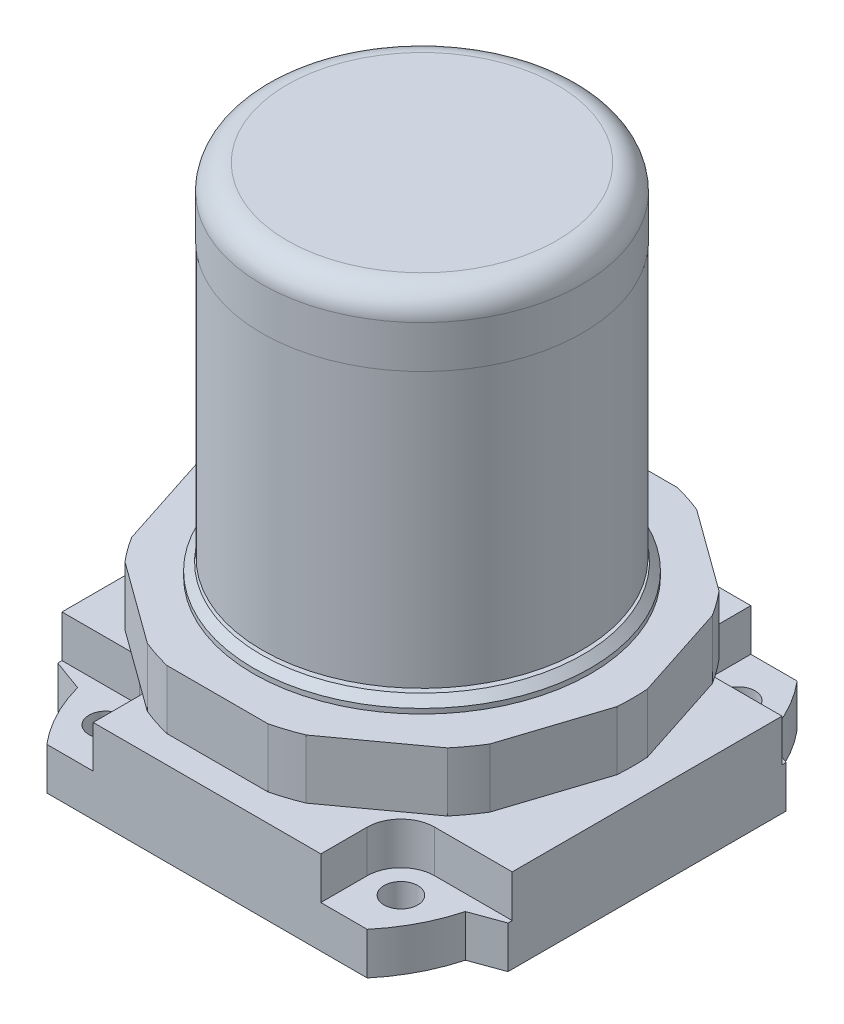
ISO-10303-21;
HEADER;
FILE_DESCRIPTION(('STEP AP214'),'2;1');
FILE_NAME('part.step','',(''),(''),'','','');
FILE_SCHEMA(('AUTOMOTIVE_DESIGN { 1 0 10303 214 1 1 1 1 }'));
ENDSEC;
DATA;
#1=APPLICATION_CONTEXT('core data for automotive mechanical design processes');
#2=APPLICATION_PROTOCOL_DEFINITION('international standard','automotive_design',2000,#1);
#3=PRODUCT_CONTEXT('',#1,'mechanical');
#4=PRODUCT('Part','Part','',(#3));
#5=PRODUCT_RELATED_PRODUCT_CATEGORY('part','',(#4));
#6=PRODUCT_DEFINITION_FORMATION('','',#4);
#7=PRODUCT_DEFINITION_CONTEXT('part definition',#1,'design');
#8=PRODUCT_DEFINITION('design','',#6,#7);
#9=PRODUCT_DEFINITION_SHAPE('','',#8);
#10=(LENGTH_UNIT() NAMED_UNIT(*) SI_UNIT(.MILLI.,.METRE.));
#11=(NAMED_UNIT(*) PLANE_ANGLE_UNIT() SI_UNIT($,.RADIAN.));
#12=(NAMED_UNIT(*) SI_UNIT($,.STERADIAN.) SOLID_ANGLE_UNIT());
#13=UNCERTAINTY_MEASURE_WITH_UNIT(LENGTH_MEASURE(1.E-05),#10,'distance_accuracy_value','');
#14=(GEOMETRIC_REPRESENTATION_CONTEXT(3) GLOBAL_UNCERTAINTY_ASSIGNED_CONTEXT((#13)) GLOBAL_UNIT_ASSIGNED_CONTEXT((#10,
#11,#12)) REPRESENTATION_CONTEXT('',''));
#15=CARTESIAN_POINT('',(0.,0.,0.));
#16=DIRECTION('',(0.,0.,1.));
#17=DIRECTION('',(1.,0.,0.));
#18=AXIS2_PLACEMENT_3D('',#15,#16,#17);
#19=CARTESIAN_POINT('',(0.,12.,0.));
#20=DIRECTION('',(0.,1.,0.));
#21=DIRECTION('',(0.,0.,1.));
#22=AXIS2_PLACEMENT_3D('',#19,#20,#21);
#23=CYLINDRICAL_SURFACE('',#22,25.);
#24=CARTESIAN_POINT('',(0.,12.,0.));
#25=DIRECTION('',(0.,1.,0.));
#26=DIRECTION('',(0.,0.,1.));
#27=AXIS2_PLACEMENT_3D('',#24,#25,#26);
#28=CIRCLE('',#27,25.);
#29=CARTESIAN_POINT('',(-24.9348422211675,12.,-1.80378585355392));
#30=VERTEX_POINT('',#29);
#31=CARTESIAN_POINT('',(-24.9348422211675,12.,1.8037858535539));
#32=VERTEX_POINT('',#31);
#33=EDGE_CURVE('E711',#30,#32,#28,.T.);
#34=ORIENTED_EDGE('',*,*,#33,.T.);
#35=DIRECTION('',(0.,1.,0.));
#36=VECTOR('',#35,1.);
#37=CARTESIAN_POINT('',(-24.9348422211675,12.,1.8037858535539));
#38=LINE('',#37,#36);
#39=CARTESIAN_POINT('',(-24.9348422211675,19.,1.80378585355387));
#40=VERTEX_POINT('',#39);
#41=EDGE_CURVE('E380',#32,#40,#38,.T.);
#42=ORIENTED_EDGE('',*,*,#41,.T.);
#43=CARTESIAN_POINT('',(0.,19.,0.));
#44=DIRECTION('',(0.,1.,0.));
#45=DIRECTION('',(0.,0.,1.));
#46=AXIS2_PLACEMENT_3D('',#43,#44,#45);
#47=CIRCLE('',#46,25.);
#48=CARTESIAN_POINT('',(-24.9348422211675,19.,-1.80378585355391));
#49=VERTEX_POINT('',#48);
#50=EDGE_CURVE('E369',#49,#40,#47,.T.);
#51=ORIENTED_EDGE('',*,*,#50,.F.);
#52=DIRECTION('',(0.,1.,0.));
#53=VECTOR('',#52,1.);
#54=CARTESIAN_POINT('',(-24.9348422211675,12.,-1.80378585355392));
#55=LINE('',#54,#53);
#56=EDGE_CURVE('E347',#49,#30,#55,.F.);
#57=ORIENTED_EDGE('',*,*,#56,.T.);
#58=EDGE_LOOP('',(#34,#42,#51,#57));
#59=FACE_BOUND('',#58,.T.);
#60=ADVANCED_FACE('F37',(#59),#23,.T.);
#61=CARTESIAN_POINT('',(-21.2329498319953,19.,13.1970391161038));
#62=VERTEX_POINT('',#61);
#63=CARTESIAN_POINT('',(-19.1124723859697,19.,16.1156259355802));
#64=VERTEX_POINT('',#63);
#65=EDGE_CURVE('E372',#62,#64,#47,.T.);
#66=ORIENTED_EDGE('',*,*,#65,.F.);
#67=DIRECTION('',(0.,1.,0.));
#68=VECTOR('',#67,1.);
#69=CARTESIAN_POINT('',(-21.2329498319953,12.,13.1970391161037));
#70=LINE('',#69,#68);
#71=CARTESIAN_POINT('',(-21.2329498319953,12.,13.1970391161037));
#72=VERTEX_POINT('',#71);
#73=EDGE_CURVE('E60',#62,#72,#70,.F.);
#74=ORIENTED_EDGE('',*,*,#73,.T.);
#75=CARTESIAN_POINT('',(-19.1124723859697,12.,16.1156259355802));
#76=VERTEX_POINT('',#75);
#77=EDGE_CURVE('E703',#72,#76,#28,.T.);
#78=ORIENTED_EDGE('',*,*,#77,.T.);
#79=DIRECTION('',(0.,1.,0.));
#80=VECTOR('',#79,1.);
#81=CARTESIAN_POINT('',(-19.1124723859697,12.,16.1156259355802));
#82=LINE('',#81,#80);
#83=EDGE_CURVE('E733',#76,#64,#82,.T.);
#84=ORIENTED_EDGE('',*,*,#83,.T.);
#85=EDGE_LOOP('',(#66,#74,#78,#84));
#86=FACE_BOUND('',#85,.T.);
#87=ADVANCED_FACE('F675',(#86),#23,.T.);
#88=CARTESIAN_POINT('',(-9.42079228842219,19.,23.1570436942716));
#89=VERTEX_POINT('',#88);
#90=CARTESIAN_POINT('',(-5.98978770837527,19.,24.2718446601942));
#91=VERTEX_POINT('',#90);
#92=EDGE_CURVE('E379',#89,#91,#47,.T.);
#93=ORIENTED_EDGE('',*,*,#92,.F.);
#94=DIRECTION('',(0.,1.,0.));
#95=VECTOR('',#94,1.);
#96=CARTESIAN_POINT('',(-9.42079228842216,12.,23.1570436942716));
#97=LINE('',#96,#95);
#98=CARTESIAN_POINT('',(-9.42079228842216,12.,23.1570436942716));
#99=VERTEX_POINT('',#98);
#100=EDGE_CURVE('E52',#89,#99,#97,.F.);
#101=ORIENTED_EDGE('',*,*,#100,.T.);
#102=CARTESIAN_POINT('',(-5.98978770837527,12.,24.2718446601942));
#103=VERTEX_POINT('',#102);
#104=EDGE_CURVE('E377',#99,#103,#28,.T.);
#105=ORIENTED_EDGE('',*,*,#104,.T.);
#106=DIRECTION('',(0.,1.,0.));
#107=VECTOR('',#106,1.);
#108=CARTESIAN_POINT('',(-5.98978770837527,12.,24.2718446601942));
#109=LINE('',#108,#107);
#110=EDGE_CURVE('E716',#103,#91,#109,.T.);
#111=ORIENTED_EDGE('',*,*,#110,.T.);
#112=EDGE_LOOP('',(#93,#101,#105,#111));
#113=FACE_BOUND('',#112,.T.);
#114=ADVANCED_FACE('F680',(#113),#23,.T.);
#115=CARTESIAN_POINT('',(5.98978770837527,19.,24.2718446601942));
#116=VERTEX_POINT('',#115);
#117=CARTESIAN_POINT('',(9.42079228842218,19.,23.1570436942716));
#118=VERTEX_POINT('',#117);
#119=EDGE_CURVE('E373',#116,#118,#47,.T.);
#120=ORIENTED_EDGE('',*,*,#119,.F.);
#121=DIRECTION('',(0.,1.,0.));
#122=VECTOR('',#121,1.);
#123=CARTESIAN_POINT('',(5.98978770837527,12.,24.2718446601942));
#124=LINE('',#123,#122);
#125=CARTESIAN_POINT('',(5.98978770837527,12.,24.2718446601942));
#126=VERTEX_POINT('',#125);
#127=EDGE_CURVE('E724',#116,#126,#124,.F.);
#128=ORIENTED_EDGE('',*,*,#127,.T.);
#129=CARTESIAN_POINT('',(9.42079228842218,12.,23.1570436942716));
#130=VERTEX_POINT('',#129);
#131=EDGE_CURVE('E382',#126,#130,#28,.T.);
#132=ORIENTED_EDGE('',*,*,#131,.T.);
#133=DIRECTION('',(0.,1.,0.));
#134=VECTOR('',#133,1.);
#135=CARTESIAN_POINT('',(9.42079228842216,12.,23.1570436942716));
#136=LINE('',#135,#134);
#137=EDGE_CURVE('E727',#130,#118,#136,.T.);
#138=ORIENTED_EDGE('',*,*,#137,.T.);
#139=EDGE_LOOP('',(#120,#128,#132,#138));
#140=FACE_BOUND('',#139,.T.);
#141=ADVANCED_FACE('F815',(#140),#23,.T.);
#142=CARTESIAN_POINT('',(19.1124723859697,19.,16.1156259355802));
#143=VERTEX_POINT('',#142);
#144=CARTESIAN_POINT('',(21.2329498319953,19.,13.1970391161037));
#145=VERTEX_POINT('',#144);
#146=EDGE_CURVE('E378',#143,#145,#47,.T.);
#147=ORIENTED_EDGE('',*,*,#146,.F.);
#148=DIRECTION('',(0.,1.,0.));
#149=VECTOR('',#148,1.);
#150=CARTESIAN_POINT('',(19.1124723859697,12.,16.1156259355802));
#151=LINE('',#150,#149);
#152=CARTESIAN_POINT('',(19.1124723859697,12.,16.1156259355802));
#153=VERTEX_POINT('',#152);
#154=EDGE_CURVE('E808',#143,#153,#151,.F.);
#155=ORIENTED_EDGE('',*,*,#154,.T.);
#156=CARTESIAN_POINT('',(21.2329498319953,12.,13.1970391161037));
#157=VERTEX_POINT('',#156);
#158=EDGE_CURVE('E386',#153,#157,#28,.T.);
#159=ORIENTED_EDGE('',*,*,#158,.T.);
#160=DIRECTION('',(0.,1.,0.));
#161=VECTOR('',#160,1.);
#162=CARTESIAN_POINT('',(21.2329498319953,12.,13.1970391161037));
#163=LINE('',#162,#161);
#164=EDGE_CURVE('E805',#157,#145,#163,.T.);
#165=ORIENTED_EDGE('',*,*,#164,.T.);
#166=EDGE_LOOP('',(#147,#155,#159,#165));
#167=FACE_BOUND('',#166,.T.);
#168=ADVANCED_FACE('F1041',(#167),#23,.T.);
#169=CARTESIAN_POINT('',(24.9348422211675,19.,1.80378585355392));
#170=VERTEX_POINT('',#169);
#171=CARTESIAN_POINT('',(24.9348422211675,19.,-1.80378585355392));
#172=VERTEX_POINT('',#171);
#173=EDGE_CURVE('E1397',#170,#172,#47,.T.);
#174=ORIENTED_EDGE('',*,*,#173,.F.);
#175=DIRECTION('',(0.,1.,0.));
#176=VECTOR('',#175,1.);
#177=CARTESIAN_POINT('',(24.9348422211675,12.,1.80378585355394));
#178=LINE('',#177,#176);
#179=CARTESIAN_POINT('',(24.9348422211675,12.,1.80378585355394));
#180=VERTEX_POINT('',#179);
#181=EDGE_CURVE('E799',#170,#180,#178,.F.);
#182=ORIENTED_EDGE('',*,*,#181,.T.);
#183=CARTESIAN_POINT('',(24.9348422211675,12.,-1.80378585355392));
#184=VERTEX_POINT('',#183);
#185=EDGE_CURVE('E1395',#180,#184,#28,.T.);
#186=ORIENTED_EDGE('',*,*,#185,.T.);
#187=DIRECTION('',(0.,1.,0.));
#188=VECTOR('',#187,1.);
#189=CARTESIAN_POINT('',(24.9348422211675,12.,-1.80378585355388));
#190=LINE('',#189,#188);
#191=EDGE_CURVE('E796',#184,#172,#190,.T.);
#192=ORIENTED_EDGE('',*,*,#191,.T.);
#193=EDGE_LOOP('',(#174,#182,#186,#192));
#194=FACE_BOUND('',#193,.T.);
#195=ADVANCED_FACE('F849',(#194),#23,.T.);
#196=CARTESIAN_POINT('',(21.2329498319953,19.,-13.1970391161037));
#197=VERTEX_POINT('',#196);
#198=CARTESIAN_POINT('',(19.1124723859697,19.,-16.1156259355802));
#199=VERTEX_POINT('',#198);
#200=EDGE_CURVE('E1411',#197,#199,#47,.T.);
#201=ORIENTED_EDGE('',*,*,#200,.F.);
#202=DIRECTION('',(0.,1.,0.));
#203=VECTOR('',#202,1.);
#204=CARTESIAN_POINT('',(21.2329498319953,12.,-13.1970391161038));
#205=LINE('',#204,#203);
#206=CARTESIAN_POINT('',(21.2329498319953,12.,-13.1970391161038));
#207=VERTEX_POINT('',#206);
#208=EDGE_CURVE('E790',#197,#207,#205,.F.);
#209=ORIENTED_EDGE('',*,*,#208,.T.);
#210=CARTESIAN_POINT('',(19.1124723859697,12.,-16.1156259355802));
#211=VERTEX_POINT('',#210);
#212=EDGE_CURVE('E1399',#207,#211,#28,.T.);
#213=ORIENTED_EDGE('',*,*,#212,.T.);
#214=DIRECTION('',(0.,1.,0.));
#215=VECTOR('',#214,1.);
#216=CARTESIAN_POINT('',(19.1124723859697,12.,-16.1156259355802));
#217=LINE('',#216,#215);
#218=EDGE_CURVE('E787',#211,#199,#217,.T.);
#219=ORIENTED_EDGE('',*,*,#218,.T.);
#220=EDGE_LOOP('',(#201,#209,#213,#219));
#221=FACE_BOUND('',#220,.T.);
#222=ADVANCED_FACE('F917',(#221),#23,.T.);
#223=CARTESIAN_POINT('',(9.42079228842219,19.,-23.1570436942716));
#224=VERTEX_POINT('',#223);
#225=CARTESIAN_POINT('',(5.98978770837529,19.,-24.2718446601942));
#226=VERTEX_POINT('',#225);
#227=EDGE_CURVE('E371',#224,#226,#47,.T.);
#228=ORIENTED_EDGE('',*,*,#227,.F.);
#229=DIRECTION('',(0.,1.,0.));
#230=VECTOR('',#229,1.);
#231=CARTESIAN_POINT('',(9.42079228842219,12.,-23.1570436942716));
#232=LINE('',#231,#230);
#233=CARTESIAN_POINT('',(9.42079228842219,12.,-23.1570436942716));
#234=VERTEX_POINT('',#233);
#235=EDGE_CURVE('E781',#224,#234,#232,.F.);
#236=ORIENTED_EDGE('',*,*,#235,.T.);
#237=CARTESIAN_POINT('',(5.98978770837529,12.,-24.2718446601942));
#238=VERTEX_POINT('',#237);
#239=EDGE_CURVE('E1401',#234,#238,#28,.T.);
#240=ORIENTED_EDGE('',*,*,#239,.T.);
#241=DIRECTION('',(0.,1.,0.));
#242=VECTOR('',#241,1.);
#243=CARTESIAN_POINT('',(5.98978770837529,12.,-24.2718446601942));
#244=LINE('',#243,#242);
#245=EDGE_CURVE('E778',#238,#226,#244,.T.);
#246=ORIENTED_EDGE('',*,*,#245,.T.);
#247=EDGE_LOOP('',(#228,#236,#240,#246));
#248=FACE_BOUND('',#247,.T.);
#249=ADVANCED_FACE('F665',(#248),#23,.T.);
#250=CARTESIAN_POINT('',(-5.98978770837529,19.,-24.2718446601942));
#251=VERTEX_POINT('',#250);
#252=CARTESIAN_POINT('',(-9.42079228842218,19.,-23.1570436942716));
#253=VERTEX_POINT('',#252);
#254=EDGE_CURVE('E368',#251,#253,#47,.T.);
#255=ORIENTED_EDGE('',*,*,#254,.F.);
#256=DIRECTION('',(0.,1.,0.));
#257=VECTOR('',#256,1.);
#258=CARTESIAN_POINT('',(-5.98978770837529,12.,-24.2718446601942));
#259=LINE('',#258,#257);
#260=CARTESIAN_POINT('',(-5.98978770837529,12.,-24.2718446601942));
#261=VERTEX_POINT('',#260);
#262=EDGE_CURVE('E772',#251,#261,#259,.F.);
#263=ORIENTED_EDGE('',*,*,#262,.T.);
#264=CARTESIAN_POINT('',(-9.4207922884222,12.,-23.1570436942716));
#265=VERTEX_POINT('',#264);
#266=EDGE_CURVE('E1403',#261,#265,#28,.T.);
#267=ORIENTED_EDGE('',*,*,#266,.T.);
#268=DIRECTION('',(0.,1.,0.));
#269=VECTOR('',#268,1.);
#270=CARTESIAN_POINT('',(-9.42079228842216,12.,-23.1570436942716));
#271=LINE('',#270,#269);
#272=EDGE_CURVE('E769',#265,#253,#271,.T.);
#273=ORIENTED_EDGE('',*,*,#272,.T.);
#274=EDGE_LOOP('',(#255,#263,#267,#273));
#275=FACE_BOUND('',#274,.T.);
#276=ADVANCED_FACE('F654',(#275),#23,.T.);
#277=CARTESIAN_POINT('',(0.,10.,0.));
#278=DIRECTION('',(0.,1.,0.));
#279=DIRECTION('',(0.,0.,1.));
#280=AXIS2_PLACEMENT_3D('',#277,#278,#279);
#281=CYLINDRICAL_SURFACE('',#280,20.);
#282=CARTESIAN_POINT('',(0.,19.58,0.));
#283=DIRECTION('',(0.,1.,0.));
#284=DIRECTION('',(0.,0.,1.));
#285=AXIS2_PLACEMENT_3D('',#282,#283,#284);
#286=CIRCLE('',#285,20.);
#287=CARTESIAN_POINT('',(0.,19.58,20.));
#288=VERTEX_POINT('',#287);
#289=EDGE_CURVE('E389',#288,#288,#286,.T.);
#290=ORIENTED_EDGE('',*,*,#289,.F.);
#291=EDGE_LOOP('',(#290));
#292=FACE_BOUND('',#291,.T.);
#293=CARTESIAN_POINT('',(0.,19.,0.));
#294=DIRECTION('',(0.,-1.,0.));
#295=DIRECTION('',(0.,0.,-1.));
#296=AXIS2_PLACEMENT_3D('',#293,#294,#295);
#297=CIRCLE('',#296,20.);
#298=CARTESIAN_POINT('',(0.,19.,-20.));
#299=VERTEX_POINT('',#298);
#300=EDGE_CURVE('E45',#299,#299,#297,.T.);
#301=ORIENTED_EDGE('',*,*,#300,.F.);
#302=EDGE_LOOP('',(#301));
#303=FACE_BOUND('',#302,.T.);
#304=ADVANCED_FACE('F651',(#292,#303),#281,.T.);
#305=CARTESIAN_POINT('',(0.,61.5,0.));
#306=DIRECTION('',(0.,-1.,0.));
#307=DIRECTION('',(0.,0.,-1.));
#308=AXIS2_PLACEMENT_3D('',#305,#306,#307);
#309=PLANE('',#308);
#310=CARTESIAN_POINT('',(0.,61.5,0.));
#311=DIRECTION('',(0.,1.,0.));
#312=DIRECTION('',(0.,0.,1.));
#313=AXIS2_PLACEMENT_3D('',#310,#311,#312);
#314=CIRCLE('',#313,16.);
#315=CARTESIAN_POINT('',(0.,61.5,16.));
#316=VERTEX_POINT('',#315);
#317=EDGE_CURVE('E413',#316,#316,#314,.T.);
#318=ORIENTED_EDGE('',*,*,#317,.T.);
#319=EDGE_LOOP('',(#318));
#320=FACE_BOUND('',#319,.T.);
#321=ADVANCED_FACE('F653',(#320),#309,.F.);
#322=CARTESIAN_POINT('',(0.,58.5,0.));
#323=DIRECTION('',(0.,1.,0.));
#324=DIRECTION('',(0.,0.,1.));
#325=AXIS2_PLACEMENT_3D('',#322,#323,#324);
#326=TOROIDAL_SURFACE('',#325,16.,2.99999999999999);
#327=ORIENTED_EDGE('',*,*,#317,.F.);
#328=EDGE_LOOP('',(#327));
#329=FACE_BOUND('',#328,.T.);
#330=CARTESIAN_POINT('',(0.,58.5,0.));
#331=DIRECTION('',(0.,1.,0.));
#332=DIRECTION('',(0.,0.,1.));
#333=AXIS2_PLACEMENT_3D('',#330,#331,#332);
#334=CIRCLE('',#333,19.);
#335=CARTESIAN_POINT('',(0.,58.5,19.));
#336=VERTEX_POINT('',#335);
#337=EDGE_CURVE('E410',#336,#336,#334,.T.);
#338=ORIENTED_EDGE('',*,*,#337,.T.);
#339=EDGE_LOOP('',(#338));
#340=FACE_BOUND('',#339,.T.);
#341=ADVANCED_FACE('F662',(#329,#340),#326,.T.);
#342=CARTESIAN_POINT('',(0.,10.,0.));
#343=DIRECTION('',(0.,1.,0.));
#344=DIRECTION('',(0.,0.,1.));
#345=AXIS2_PLACEMENT_3D('',#342,#343,#344);
#346=CYLINDRICAL_SURFACE('',#345,19.);
#347=ORIENTED_EDGE('',*,*,#337,.F.);
#348=EDGE_LOOP('',(#347));
#349=FACE_BOUND('',#348,.T.);
#350=CARTESIAN_POINT('',(0.,53.4782608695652,0.));
#351=DIRECTION('',(0.,1.,0.));
#352=DIRECTION('',(0.,0.,1.));
#353=AXIS2_PLACEMENT_3D('',#350,#351,#352);
#354=CIRCLE('',#353,19.);
#355=CARTESIAN_POINT('',(0.,53.4782608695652,19.));
#356=VERTEX_POINT('',#355);
#357=EDGE_CURVE('E407',#356,#356,#354,.T.);
#358=ORIENTED_EDGE('',*,*,#357,.T.);
#359=EDGE_LOOP('',(#358));
#360=FACE_BOUND('',#359,.T.);
#361=ADVANCED_FACE('F907',(#349,#360),#346,.T.);
#362=CARTESIAN_POINT('',(0.,53.4782608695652,-19.));
#363=DIRECTION('',(0.,1.,0.));
#364=DIRECTION('',(0.,0.,1.));
#365=AXIS2_PLACEMENT_3D('',#362,#363,#364);
#366=PLANE('',#365);
#367=ORIENTED_EDGE('',*,*,#357,.F.);
#368=EDGE_LOOP('',(#367));
#369=FACE_BOUND('',#368,.T.);
#370=CARTESIAN_POINT('',(0.,53.4782608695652,0.));
#371=DIRECTION('',(0.,1.,0.));
#372=DIRECTION('',(0.,0.,1.));
#373=AXIS2_PLACEMENT_3D('',#370,#371,#372);
#374=CIRCLE('',#373,18.95);
#375=CARTESIAN_POINT('',(0.,53.4782608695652,18.95));
#376=VERTEX_POINT('',#375);
#377=EDGE_CURVE('E404',#376,#376,#374,.T.);
#378=ORIENTED_EDGE('',*,*,#377,.T.);
#379=EDGE_LOOP('',(#378));
#380=FACE_BOUND('',#379,.T.);
#381=ADVANCED_FACE('F902',(#369,#380),#366,.F.);
#382=CARTESIAN_POINT('',(0.,10.,0.));
#383=DIRECTION('',(0.,1.,0.));
#384=DIRECTION('',(0.,0.,1.));
#385=AXIS2_PLACEMENT_3D('',#382,#383,#384);
#386=CYLINDRICAL_SURFACE('',#385,18.95);
#387=ORIENTED_EDGE('',*,*,#377,.F.);
#388=EDGE_LOOP('',(#387));
#389=FACE_BOUND('',#388,.T.);
#390=CARTESIAN_POINT('',(0.,20.9,0.));
#391=DIRECTION('',(0.,1.,0.));
#392=DIRECTION('',(0.,0.,1.));
#393=AXIS2_PLACEMENT_3D('',#390,#391,#392);
#394=CIRCLE('',#393,18.95);
#395=CARTESIAN_POINT('',(0.,20.9,18.95));
#396=VERTEX_POINT('',#395);
#397=EDGE_CURVE('E401',#396,#396,#394,.T.);
#398=ORIENTED_EDGE('',*,*,#397,.T.);
#399=EDGE_LOOP('',(#398));
#400=FACE_BOUND('',#399,.T.);
#401=ADVANCED_FACE('F906',(#389,#400),#386,.T.);
#402=CARTESIAN_POINT('',(0.,20.9,-18.95));
#403=DIRECTION('',(0.,1.,0.));
#404=DIRECTION('',(0.,0.,1.));
#405=AXIS2_PLACEMENT_3D('',#402,#403,#404);
#406=PLANE('',#405);
#407=ORIENTED_EDGE('',*,*,#397,.F.);
#408=EDGE_LOOP('',(#407));
#409=FACE_BOUND('',#408,.T.);
#410=CARTESIAN_POINT('',(0.,20.9,0.));
#411=DIRECTION('',(0.,1.,0.));
#412=DIRECTION('',(0.,0.,1.));
#413=AXIS2_PLACEMENT_3D('',#410,#411,#412);
#414=CIRCLE('',#413,16.75);
#415=CARTESIAN_POINT('',(0.,20.9,16.75));
#416=VERTEX_POINT('',#415);
#417=EDGE_CURVE('E398',#416,#416,#414,.T.);
#418=ORIENTED_EDGE('',*,*,#417,.T.);
#419=EDGE_LOOP('',(#418));
#420=FACE_BOUND('',#419,.T.);
#421=ADVANCED_FACE('F1307',(#409,#420),#406,.F.);
#422=CARTESIAN_POINT('',(0.,10.,0.));
#423=DIRECTION('',(0.,1.,0.));
#424=DIRECTION('',(0.,0.,1.));
#425=AXIS2_PLACEMENT_3D('',#422,#423,#424);
#426=CYLINDRICAL_SURFACE('',#425,16.75);
#427=ORIENTED_EDGE('',*,*,#417,.F.);
#428=EDGE_LOOP('',(#427));
#429=FACE_BOUND('',#428,.T.);
#430=CARTESIAN_POINT('',(0.,20.5,0.));
#431=DIRECTION('',(0.,1.,0.));
#432=DIRECTION('',(0.,0.,1.));
#433=AXIS2_PLACEMENT_3D('',#430,#431,#432);
#434=CIRCLE('',#433,16.75);
#435=CARTESIAN_POINT('',(0.,20.5,16.75));
#436=VERTEX_POINT('',#435);
#437=EDGE_CURVE('E395',#436,#436,#434,.T.);
#438=ORIENTED_EDGE('',*,*,#437,.T.);
#439=EDGE_LOOP('',(#438));
#440=FACE_BOUND('',#439,.T.);
#441=ADVANCED_FACE('F1162',(#429,#440),#426,.T.);
#442=CARTESIAN_POINT('',(0.,20.5,-16.75));
#443=DIRECTION('',(0.,-1.,0.));
#444=DIRECTION('',(0.,0.,-1.));
#445=AXIS2_PLACEMENT_3D('',#442,#443,#444);
#446=PLANE('',#445);
#447=ORIENTED_EDGE('',*,*,#437,.F.);
#448=EDGE_LOOP('',(#447));
#449=FACE_BOUND('',#448,.T.);
#450=CARTESIAN_POINT('',(0.,20.5,0.));
#451=DIRECTION('',(0.,1.,0.));
#452=DIRECTION('',(0.,0.,1.));
#453=AXIS2_PLACEMENT_3D('',#450,#451,#452);
#454=CIRCLE('',#453,19.08);
#455=CARTESIAN_POINT('',(0.,20.5,19.08));
#456=VERTEX_POINT('',#455);
#457=EDGE_CURVE('E392',#456,#456,#454,.T.);
#458=ORIENTED_EDGE('',*,*,#457,.T.);
#459=EDGE_LOOP('',(#458));
#460=FACE_BOUND('',#459,.T.);
#461=ADVANCED_FACE('F696',(#449,#460),#446,.F.);
#462=CARTESIAN_POINT('',(0.,19.58,0.));
#463=DIRECTION('',(0.,-1.,0.));
#464=DIRECTION('',(0.,0.,-1.));
#465=AXIS2_PLACEMENT_3D('',#462,#463,#464);
#466=CONICAL_SURFACE('',#465,20.,0.785398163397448);
#467=ORIENTED_EDGE('',*,*,#457,.F.);
#468=EDGE_LOOP('',(#467));
#469=FACE_BOUND('',#468,.T.);
#470=ORIENTED_EDGE('',*,*,#289,.T.);
#471=EDGE_LOOP('',(#470));
#472=FACE_BOUND('',#471,.T.);
#473=ADVANCED_FACE('F691',(#469,#472),#466,.T.);
#474=CARTESIAN_POINT('',(20.,12.,0.));
#475=DIRECTION('',(0.,1.,0.));
#476=DIRECTION('',(0.,0.,1.));
#477=AXIS2_PLACEMENT_3D('',#474,#475,#476);
#478=PLANE('',#477);
#479=ORIENTED_EDGE('',*,*,#77,.F.);
#480=DIRECTION('',(-0.309016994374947,0.,-0.951056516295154));
#481=VECTOR('',#480,1.);
#482=CARTESIAN_POINT('',(-21.1740659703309,12.,13.3782650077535));
#483=LINE('',#482,#481);
#484=EDGE_CURVE('E707',#72,#32,#483,.T.);
#485=ORIENTED_EDGE('',*,*,#484,.T.);
#486=ORIENTED_EDGE('',*,*,#33,.F.);
#487=DIRECTION('',(0.309016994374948,0.,-0.951056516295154));
#488=VECTOR('',#487,1.);
#489=CARTESIAN_POINT('',(-21.1740659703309,12.,-13.3782650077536));
#490=LINE('',#489,#488);
#491=CARTESIAN_POINT('',(-21.2329498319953,12.,-13.1970391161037));
#492=VERTEX_POINT('',#491);
#493=EDGE_CURVE('E363',#30,#492,#490,.T.);
#494=ORIENTED_EDGE('',*,*,#493,.T.);
#495=CARTESIAN_POINT('',(-19.1124723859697,12.,-16.1156259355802));
#496=VERTEX_POINT('',#495);
#497=EDGE_CURVE('E361',#496,#492,#28,.T.);
#498=ORIENTED_EDGE('',*,*,#497,.F.);
#499=DIRECTION('',(0.809016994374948,0.,-0.587785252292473));
#500=VECTOR('',#499,1.);
#501=CARTESIAN_POINT('',(-1.17646239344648,12.,-29.1468999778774));
#502=LINE('',#501,#500);
#503=EDGE_CURVE('E766',#496,#265,#502,.T.);
#504=ORIENTED_EDGE('',*,*,#503,.T.);
#505=ORIENTED_EDGE('',*,*,#266,.F.);
#506=DIRECTION('',(1.,0.,0.));
#507=VECTOR('',#506,1.);
#508=CARTESIAN_POINT('',(20.,12.,-24.2718446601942));
#509=LINE('',#508,#507);
#510=EDGE_CURVE('E775',#261,#238,#509,.T.);
#511=ORIENTED_EDGE('',*,*,#510,.T.);
#512=ORIENTED_EDGE('',*,*,#239,.F.);
#513=DIRECTION('',(0.809016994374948,0.,0.587785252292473));
#514=VECTOR('',#513,1.);
#515=CARTESIAN_POINT('',(27.3568022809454,12.,-10.1257696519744));
#516=LINE('',#515,#514);
#517=EDGE_CURVE('E784',#234,#211,#516,.T.);
#518=ORIENTED_EDGE('',*,*,#517,.T.);
#519=ORIENTED_EDGE('',*,*,#212,.F.);
#520=DIRECTION('',(0.309016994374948,0.,0.951056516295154));
#521=VECTOR('',#520,1.);
#522=CARTESIAN_POINT('',(24.9937260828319,12.,-1.62255996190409));
#523=LINE('',#522,#521);
#524=EDGE_CURVE('E793',#207,#184,#523,.T.);
#525=ORIENTED_EDGE('',*,*,#524,.T.);
#526=ORIENTED_EDGE('',*,*,#185,.F.);
#527=DIRECTION('',(-0.309016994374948,0.,0.951056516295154));
#528=VECTOR('',#527,1.);
#529=CARTESIAN_POINT('',(24.9937260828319,12.,1.62255996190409));
#530=LINE('',#529,#528);
#531=EDGE_CURVE('E802',#180,#157,#530,.T.);
#532=ORIENTED_EDGE('',*,*,#531,.T.);
#533=ORIENTED_EDGE('',*,*,#158,.F.);
#534=DIRECTION('',(-0.809016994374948,0.,0.587785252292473));
#535=VECTOR('',#534,1.);
#536=CARTESIAN_POINT('',(27.3568022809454,12.,10.1257696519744));
#537=LINE('',#536,#535);
#538=EDGE_CURVE('E811',#153,#130,#537,.T.);
#539=ORIENTED_EDGE('',*,*,#538,.T.);
#540=ORIENTED_EDGE('',*,*,#131,.F.);
#541=DIRECTION('',(-1.,0.,0.));
#542=VECTOR('',#541,1.);
#543=CARTESIAN_POINT('',(20.,12.,24.2718446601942));
#544=LINE('',#543,#542);
#545=EDGE_CURVE('E720',#126,#103,#544,.T.);
#546=ORIENTED_EDGE('',*,*,#545,.T.);
#547=ORIENTED_EDGE('',*,*,#104,.F.);
#548=DIRECTION('',(-0.809016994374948,0.,-0.587785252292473));
#549=VECTOR('',#548,1.);
#550=CARTESIAN_POINT('',(-1.17646239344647,12.,29.1468999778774));
#551=LINE('',#550,#549);
#552=EDGE_CURVE('E709',#99,#76,#551,.T.);
#553=ORIENTED_EDGE('',*,*,#552,.T.);
#554=EDGE_LOOP('',(#479,#485,#486,#494,#498,#504,#505,#511,#512,#518,#519,#525,#526,#532,#533,
#539,#540,#546,#547,#553));
#555=FACE_BOUND('',#554,.T.);
#556=CARTESIAN_POINT('',(0.,12.,0.));
#557=DIRECTION('',(0.,1.,0.));
#558=DIRECTION('',(0.,0.,1.));
#559=AXIS2_PLACEMENT_3D('',#556,#557,#558);
#560=CIRCLE('',#559,20.);
#561=CARTESIAN_POINT('',(0.,12.,20.));
#562=VERTEX_POINT('',#561);
#563=EDGE_CURVE('E11',#562,#562,#560,.T.);
#564=ORIENTED_EDGE('',*,*,#563,.T.);
#565=EDGE_LOOP('',(#564));
#566=FACE_BOUND('',#565,.T.);
#567=ADVANCED_FACE('F685',(#555,#566),#478,.F.);
#568=CARTESIAN_POINT('',(-19.1124723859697,19.,-16.1156259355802));
#569=VERTEX_POINT('',#568);
#570=CARTESIAN_POINT('',(-21.2329498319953,19.,-13.1970391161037));
#571=VERTEX_POINT('',#570);
#572=EDGE_CURVE('E359',#569,#571,#47,.T.);
#573=ORIENTED_EDGE('',*,*,#572,.F.);
#574=DIRECTION('',(0.,1.,0.));
#575=VECTOR('',#574,1.);
#576=CARTESIAN_POINT('',(-19.1124723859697,12.,-16.1156259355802));
#577=LINE('',#576,#575);
#578=EDGE_CURVE('E362',#569,#496,#577,.F.);
#579=ORIENTED_EDGE('',*,*,#578,.T.);
#580=ORIENTED_EDGE('',*,*,#497,.T.);
#581=DIRECTION('',(0.,1.,0.));
#582=VECTOR('',#581,1.);
#583=CARTESIAN_POINT('',(-21.2329498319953,12.,-13.1970391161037));
#584=LINE('',#583,#582);
#585=EDGE_CURVE('E344',#492,#571,#584,.T.);
#586=ORIENTED_EDGE('',*,*,#585,.T.);
#587=EDGE_LOOP('',(#573,#579,#580,#586));
#588=FACE_BOUND('',#587,.T.);
#589=ADVANCED_FACE('F357',(#588),#23,.T.);
#590=CARTESIAN_POINT('',(25.,19.,0.));
#591=DIRECTION('',(0.,-1.,0.));
#592=DIRECTION('',(0.,0.,-1.));
#593=AXIS2_PLACEMENT_3D('',#590,#591,#592);
#594=PLANE('',#593);
#595=ORIENTED_EDGE('',*,*,#300,.T.);
#596=EDGE_LOOP('',(#595));
#597=FACE_BOUND('',#596,.T.);
#598=ORIENTED_EDGE('',*,*,#50,.T.);
#599=DIRECTION('',(0.309016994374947,0.,0.951056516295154));
#600=VECTOR('',#599,1.);
#601=CARTESIAN_POINT('',(-25.0598550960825,19.,1.41903578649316));
#602=LINE('',#601,#600);
#603=EDGE_CURVE('E740',#40,#62,#602,.T.);
#604=ORIENTED_EDGE('',*,*,#603,.T.);
#605=ORIENTED_EDGE('',*,*,#65,.T.);
#606=DIRECTION('',(0.809016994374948,0.,0.587785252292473));
#607=VECTOR('',#606,1.);
#608=CARTESIAN_POINT('',(-19.4397603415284,19.,15.8778373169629));
#609=LINE('',#608,#607);
#610=EDGE_CURVE('E739',#64,#89,#609,.T.);
#611=ORIENTED_EDGE('',*,*,#610,.T.);
#612=ORIENTED_EDGE('',*,*,#92,.T.);
#613=DIRECTION('',(1.,0.,0.));
#614=VECTOR('',#613,1.);
#615=CARTESIAN_POINT('',(-6.39433786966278,19.,24.2718446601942));
#616=LINE('',#615,#614);
#617=EDGE_CURVE('E742',#91,#116,#616,.T.);
#618=ORIENTED_EDGE('',*,*,#617,.T.);
#619=ORIENTED_EDGE('',*,*,#119,.T.);
#620=DIRECTION('',(0.809016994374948,0.,-0.587785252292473));
#621=VECTOR('',#620,1.);
#622=CARTESIAN_POINT('',(9.09350433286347,19.,23.394832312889));
#623=LINE('',#622,#621);
#624=EDGE_CURVE('E744',#118,#143,#623,.T.);
#625=ORIENTED_EDGE('',*,*,#624,.T.);
#626=ORIENTED_EDGE('',*,*,#146,.T.);
#627=DIRECTION('',(0.309016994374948,0.,-0.951056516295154));
#628=VECTOR('',#627,1.);
#629=CARTESIAN_POINT('',(21.1079369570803,19.,13.5817891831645));
#630=LINE('',#629,#628);
#631=EDGE_CURVE('E750',#145,#170,#630,.T.);
#632=ORIENTED_EDGE('',*,*,#631,.T.);
#633=ORIENTED_EDGE('',*,*,#173,.T.);
#634=DIRECTION('',(-0.309016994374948,0.,-0.951056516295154));
#635=VECTOR('',#634,1.);
#636=CARTESIAN_POINT('',(25.0598550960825,19.,-1.41903578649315));
#637=LINE('',#636,#635);
#638=EDGE_CURVE('E753',#172,#197,#637,.T.);
#639=ORIENTED_EDGE('',*,*,#638,.T.);
#640=ORIENTED_EDGE('',*,*,#200,.T.);
#641=DIRECTION('',(-0.809016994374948,0.,-0.587785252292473));
#642=VECTOR('',#641,1.);
#643=CARTESIAN_POINT('',(19.4397603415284,19.,-15.8778373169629));
#644=LINE('',#643,#642);
#645=EDGE_CURVE('E756',#199,#224,#644,.T.);
#646=ORIENTED_EDGE('',*,*,#645,.T.);
#647=ORIENTED_EDGE('',*,*,#227,.T.);
#648=DIRECTION('',(-1.,0.,0.));
#649=VECTOR('',#648,1.);
#650=CARTESIAN_POINT('',(6.3943378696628,19.,-24.2718446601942));
#651=LINE('',#650,#649);
#652=EDGE_CURVE('E759',#226,#251,#651,.T.);
#653=ORIENTED_EDGE('',*,*,#652,.T.);
#654=ORIENTED_EDGE('',*,*,#254,.T.);
#655=DIRECTION('',(-0.809016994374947,0.,0.587785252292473));
#656=VECTOR('',#655,1.);
#657=CARTESIAN_POINT('',(-9.09350433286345,19.,-23.394832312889));
#658=LINE('',#657,#656);
#659=EDGE_CURVE('E352',#253,#569,#658,.T.);
#660=ORIENTED_EDGE('',*,*,#659,.T.);
#661=ORIENTED_EDGE('',*,*,#572,.T.);
#662=DIRECTION('',(-0.309016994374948,0.,0.951056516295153));
#663=VECTOR('',#662,1.);
#664=CARTESIAN_POINT('',(-21.1079369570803,19.,-13.5817891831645));
#665=LINE('',#664,#663);
#666=EDGE_CURVE('E341',#571,#49,#665,.T.);
#667=ORIENTED_EDGE('',*,*,#666,.T.);
#668=EDGE_LOOP('',(#598,#604,#605,#611,#612,#618,#619,#625,#626,#632,#633,#639,#640,#646,#647,
#653,#654,#660,#661,#667));
#669=FACE_BOUND('',#668,.T.);
#670=ADVANCED_FACE('F366',(#597,#669),#594,.F.);
#671=CARTESIAN_POINT('',(-17.5,10.,-20.));
#672=DIRECTION('',(0.,-1.,0.));
#673=DIRECTION('',(0.,0.,-1.));
#674=AXIS2_PLACEMENT_3D('',#671,#672,#673);
#675=CYLINDRICAL_SURFACE('',#674,2.);
#676=CARTESIAN_POINT('',(-17.5,0.,-20.));
#677=DIRECTION('',(0.,1.,0.));
#678=DIRECTION('',(0.,0.,1.));
#679=AXIS2_PLACEMENT_3D('',#676,#677,#678);
#680=CIRCLE('',#679,2.);
#681=CARTESIAN_POINT('',(-17.5,0.,-18.));
#682=VERTEX_POINT('',#681);
#683=EDGE_CURVE('E559',#682,#682,#680,.T.);
#684=ORIENTED_EDGE('',*,*,#683,.F.);
#685=EDGE_LOOP('',(#684));
#686=FACE_BOUND('',#685,.T.);
#687=CARTESIAN_POINT('',(-17.5,5.,-20.));
#688=DIRECTION('',(0.,1.,0.));
#689=DIRECTION('',(0.,0.,1.));
#690=AXIS2_PLACEMENT_3D('',#687,#688,#689);
#691=CIRCLE('',#690,2.);
#692=CARTESIAN_POINT('',(-17.5,5.,-18.));
#693=VERTEX_POINT('',#692);
#694=EDGE_CURVE('E510',#693,#693,#691,.T.);
#695=ORIENTED_EDGE('',*,*,#694,.T.);
#696=EDGE_LOOP('',(#695));
#697=FACE_BOUND('',#696,.T.);
#698=ADVANCED_FACE('F690',(#686,#697),#675,.F.);
#699=CARTESIAN_POINT('',(17.5,10.,20.));
#700=DIRECTION('',(0.,-1.,0.));
#701=DIRECTION('',(0.,0.,-1.));
#702=AXIS2_PLACEMENT_3D('',#699,#700,#701);
#703=CYLINDRICAL_SURFACE('',#702,2.);
#704=CARTESIAN_POINT('',(17.5,0.,20.));
#705=DIRECTION('',(0.,1.,0.));
#706=DIRECTION('',(0.,0.,1.));
#707=AXIS2_PLACEMENT_3D('',#704,#705,#706);
#708=CIRCLE('',#707,2.);
#709=CARTESIAN_POINT('',(17.5,0.,22.));
#710=VERTEX_POINT('',#709);
#711=EDGE_CURVE('E562',#710,#710,#708,.T.);
#712=ORIENTED_EDGE('',*,*,#711,.F.);
#713=EDGE_LOOP('',(#712));
#714=FACE_BOUND('',#713,.T.);
#715=CARTESIAN_POINT('',(17.5,5.,20.));
#716=DIRECTION('',(0.,1.,0.));
#717=DIRECTION('',(0.,0.,1.));
#718=AXIS2_PLACEMENT_3D('',#715,#716,#717);
#719=CIRCLE('',#718,2.);
#720=CARTESIAN_POINT('',(17.5,5.,22.));
#721=VERTEX_POINT('',#720);
#722=EDGE_CURVE('E474',#721,#721,#719,.T.);
#723=ORIENTED_EDGE('',*,*,#722,.T.);
#724=EDGE_LOOP('',(#723));
#725=FACE_BOUND('',#724,.T.);
#726=ADVANCED_FACE('F1029',(#714,#725),#703,.F.);
#727=CARTESIAN_POINT('',(17.5,10.,-20.));
#728=DIRECTION('',(0.,-1.,0.));
#729=DIRECTION('',(0.,0.,-1.));
#730=AXIS2_PLACEMENT_3D('',#727,#728,#729);
#731=CYLINDRICAL_SURFACE('',#730,2.);
#732=CARTESIAN_POINT('',(17.5,0.,-20.));
#733=DIRECTION('',(0.,1.,0.));
#734=DIRECTION('',(0.,0.,1.));
#735=AXIS2_PLACEMENT_3D('',#732,#733,#734);
#736=CIRCLE('',#735,2.);
#737=CARTESIAN_POINT('',(17.5,0.,-18.));
#738=VERTEX_POINT('',#737);
#739=EDGE_CURVE('E565',#738,#738,#736,.T.);
#740=ORIENTED_EDGE('',*,*,#739,.F.);
#741=EDGE_LOOP('',(#740));
#742=FACE_BOUND('',#741,.T.);
#743=CARTESIAN_POINT('',(17.5,5.,-20.));
#744=DIRECTION('',(0.,1.,0.));
#745=DIRECTION('',(0.,0.,1.));
#746=AXIS2_PLACEMENT_3D('',#743,#744,#745);
#747=CIRCLE('',#746,2.);
#748=CARTESIAN_POINT('',(17.5,5.,-18.));
#749=VERTEX_POINT('',#748);
#750=EDGE_CURVE('E545',#749,#749,#747,.T.);
#751=ORIENTED_EDGE('',*,*,#750,.T.);
#752=EDGE_LOOP('',(#751));
#753=FACE_BOUND('',#752,.T.);
#754=ADVANCED_FACE('F892',(#742,#753),#731,.F.);
#755=CARTESIAN_POINT('',(-17.5,10.,20.));
#756=DIRECTION('',(0.,-1.,0.));
#757=DIRECTION('',(0.,0.,-1.));
#758=AXIS2_PLACEMENT_3D('',#755,#756,#757);
#759=CYLINDRICAL_SURFACE('',#758,2.);
#760=CARTESIAN_POINT('',(-17.5,0.,20.));
#761=DIRECTION('',(0.,1.,0.));
#762=DIRECTION('',(0.,0.,1.));
#763=AXIS2_PLACEMENT_3D('',#760,#761,#762);
#764=CIRCLE('',#763,2.);
#765=CARTESIAN_POINT('',(-17.5,0.,22.));
#766=VERTEX_POINT('',#765);
#767=EDGE_CURVE('E556',#766,#766,#764,.T.);
#768=ORIENTED_EDGE('',*,*,#767,.F.);
#769=EDGE_LOOP('',(#768));
#770=FACE_BOUND('',#769,.T.);
#771=CARTESIAN_POINT('',(-17.5,5.,20.));
#772=DIRECTION('',(0.,1.,0.));
#773=DIRECTION('',(0.,0.,1.));
#774=AXIS2_PLACEMENT_3D('',#771,#772,#773);
#775=CIRCLE('',#774,2.);
#776=CARTESIAN_POINT('',(-17.5,5.,22.));
#777=VERTEX_POINT('',#776);
#778=EDGE_CURVE('E440',#777,#777,#775,.T.);
#779=ORIENTED_EDGE('',*,*,#778,.T.);
#780=EDGE_LOOP('',(#779));
#781=FACE_BOUND('',#780,.T.);
#782=ADVANCED_FACE('F886',(#770,#781),#759,.F.);
#783=CARTESIAN_POINT('',(-26.7,10.,16.5));
#784=DIRECTION('',(0.342020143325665,0.,-0.93969262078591));
#785=DIRECTION('',(-0.93969262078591,0.,-0.342020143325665));
#786=AXIS2_PLACEMENT_3D('',#783,#784,#785);
#787=PLANE('',#786);
#788=DIRECTION('',(0.93969262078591,0.,0.342020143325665));
#789=VECTOR('',#788,1.);
#790=CARTESIAN_POINT('',(-26.7,5.,16.5));
#791=LINE('',#790,#789);
#792=CARTESIAN_POINT('',(-26.7,5.,16.5));
#793=VERTEX_POINT('',#792);
#794=CARTESIAN_POINT('',(-23.,5.,17.8466898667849));
#795=VERTEX_POINT('',#794);
#796=EDGE_CURVE('E449',#793,#795,#791,.T.);
#797=ORIENTED_EDGE('',*,*,#796,.F.);
#798=DIRECTION('',(0.,-1.,0.));
#799=VECTOR('',#798,1.);
#800=CARTESIAN_POINT('',(-26.7,10.,16.5));
#801=LINE('',#800,#799);
#802=CARTESIAN_POINT('',(-26.7,0.,16.5));
#803=VERTEX_POINT('',#802);
#804=EDGE_CURVE('E636',#793,#803,#801,.T.);
#805=ORIENTED_EDGE('',*,*,#804,.T.);
#806=DIRECTION('',(0.93969262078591,0.,0.342020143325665));
#807=VECTOR('',#806,1.);
#808=CARTESIAN_POINT('',(-26.7,0.,16.5));
#809=LINE('',#808,#807);
#810=CARTESIAN_POINT('',(-23.,0.,17.8466898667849));
#811=VERTEX_POINT('',#810);
#812=EDGE_CURVE('E588',#803,#811,#809,.T.);
#813=ORIENTED_EDGE('',*,*,#812,.T.);
#814=DIRECTION('',(0.,-1.,0.));
#815=VECTOR('',#814,1.);
#816=CARTESIAN_POINT('',(-23.,10.,17.8466898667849));
#817=LINE('',#816,#815);
#818=EDGE_CURVE('E634',#795,#811,#817,.T.);
#819=ORIENTED_EDGE('',*,*,#818,.F.);
#820=EDGE_LOOP('',(#797,#805,#813,#819));
#821=FACE_BOUND('',#820,.T.);
#822=ADVANCED_FACE('F891',(#821),#787,.F.);
#823=CARTESIAN_POINT('',(-23.,10.,-17.8466898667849));
#824=DIRECTION('',(0.342020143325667,0.,0.939692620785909));
#825=DIRECTION('',(0.939692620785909,0.,-0.342020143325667));
#826=AXIS2_PLACEMENT_3D('',#823,#824,#825);
#827=PLANE('',#826);
#828=DIRECTION('',(-0.939692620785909,0.,0.342020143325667));
#829=VECTOR('',#828,1.);
#830=CARTESIAN_POINT('',(-23.,5.,-17.8466898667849));
#831=LINE('',#830,#829);
#832=CARTESIAN_POINT('',(-23.,5.,-17.846689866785));
#833=VERTEX_POINT('',#832);
#834=CARTESIAN_POINT('',(-26.7,5.,-16.5));
#835=VERTEX_POINT('',#834);
#836=EDGE_CURVE('E519',#833,#835,#831,.T.);
#837=ORIENTED_EDGE('',*,*,#836,.F.);
#838=DIRECTION('',(0.,-1.,0.));
#839=VECTOR('',#838,1.);
#840=CARTESIAN_POINT('',(-23.,10.,-17.846689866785));
#841=LINE('',#840,#839);
#842=CARTESIAN_POINT('',(-23.,0.,-17.846689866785));
#843=VERTEX_POINT('',#842);
#844=EDGE_CURVE('E582',#833,#843,#841,.T.);
#845=ORIENTED_EDGE('',*,*,#844,.T.);
#846=DIRECTION('',(-0.939692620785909,0.,0.342020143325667));
#847=VECTOR('',#846,1.);
#848=CARTESIAN_POINT('',(-23.,0.,-17.8466898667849));
#849=LINE('',#848,#847);
#850=CARTESIAN_POINT('',(-26.7,0.,-16.5));
#851=VERTEX_POINT('',#850);
#852=EDGE_CURVE('E568',#843,#851,#849,.T.);
#853=ORIENTED_EDGE('',*,*,#852,.T.);
#854=DIRECTION('',(0.,-1.,0.));
#855=VECTOR('',#854,1.);
#856=CARTESIAN_POINT('',(-26.7,10.,-16.5));
#857=LINE('',#856,#855);
#858=EDGE_CURVE('E638',#835,#851,#857,.T.);
#859=ORIENTED_EDGE('',*,*,#858,.F.);
#860=EDGE_LOOP('',(#837,#845,#853,#859));
#861=FACE_BOUND('',#860,.T.);
#862=ADVANCED_FACE('F39',(#861),#827,.F.);
#863=CARTESIAN_POINT('',(-3.69292213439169,10.,-12.627806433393));
#864=DIRECTION('',(0.,-1.,0.));
#865=DIRECTION('',(0.,0.,-1.));
#866=AXIS2_PLACEMENT_3D('',#863,#864,#865);
#867=CYLINDRICAL_SURFACE('',#866,19.9999999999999);
#868=CARTESIAN_POINT('',(-3.69292213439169,5.,-12.627806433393));
#869=DIRECTION('',(0.,1.,0.));
#870=DIRECTION('',(0.,0.,1.));
#871=AXIS2_PLACEMENT_3D('',#868,#869,#870);
#872=CIRCLE('',#871,19.9999999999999);
#873=CARTESIAN_POINT('',(-19.,5.,-25.5));
#874=VERTEX_POINT('',#873);
#875=EDGE_CURVE('E517',#874,#833,#872,.T.);
#876=ORIENTED_EDGE('',*,*,#875,.F.);
#877=DIRECTION('',(0.,-1.,0.));
#878=VECTOR('',#877,1.);
#879=CARTESIAN_POINT('',(-19.,10.,-25.5));
#880=LINE('',#879,#878);
#881=CARTESIAN_POINT('',(-19.,0.,-25.5));
#882=VERTEX_POINT('',#881);
#883=EDGE_CURVE('E618',#874,#882,#880,.T.);
#884=ORIENTED_EDGE('',*,*,#883,.T.);
#885=CARTESIAN_POINT('',(-3.69292213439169,0.,-12.627806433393));
#886=DIRECTION('',(0.,1.,0.));
#887=DIRECTION('',(0.,0.,1.));
#888=AXIS2_PLACEMENT_3D('',#885,#886,#887);
#889=CIRCLE('',#888,19.9999999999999);
#890=EDGE_CURVE('E573',#882,#843,#889,.T.);
#891=ORIENTED_EDGE('',*,*,#890,.T.);
#892=ORIENTED_EDGE('',*,*,#844,.F.);
#893=EDGE_LOOP('',(#876,#884,#891,#892));
#894=FACE_BOUND('',#893,.T.);
#895=ADVANCED_FACE('F1236',(#894),#867,.T.);
#896=CARTESIAN_POINT('',(3.69292213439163,10.,-12.627806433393));
#897=DIRECTION('',(0.,-1.,0.));
#898=DIRECTION('',(0.,0.,-1.));
#899=AXIS2_PLACEMENT_3D('',#896,#897,#898);
#900=CYLINDRICAL_SURFACE('',#899,19.9999999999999);
#901=CARTESIAN_POINT('',(3.69292213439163,5.,-12.627806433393));
#902=DIRECTION('',(0.,1.,0.));
#903=DIRECTION('',(0.,0.,1.));
#904=AXIS2_PLACEMENT_3D('',#901,#902,#903);
#905=CIRCLE('',#904,19.9999999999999);
#906=CARTESIAN_POINT('',(23.,5.,-17.8466898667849));
#907=VERTEX_POINT('',#906);
#908=CARTESIAN_POINT('',(19.,5.,-25.5));
#909=VERTEX_POINT('',#908);
#910=EDGE_CURVE('E552',#907,#909,#905,.T.);
#911=ORIENTED_EDGE('',*,*,#910,.F.);
#912=DIRECTION('',(0.,-1.,0.));
#913=VECTOR('',#912,1.);
#914=CARTESIAN_POINT('',(23.,10.,-17.8466898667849));
#915=LINE('',#914,#913);
#916=CARTESIAN_POINT('',(23.,0.,-17.8466898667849));
#917=VERTEX_POINT('',#916);
#918=EDGE_CURVE('E622',#907,#917,#915,.T.);
#919=ORIENTED_EDGE('',*,*,#918,.T.);
#920=CARTESIAN_POINT('',(3.69292213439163,0.,-12.627806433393));
#921=DIRECTION('',(0.,1.,0.));
#922=DIRECTION('',(0.,0.,1.));
#923=AXIS2_PLACEMENT_3D('',#920,#921,#922);
#924=CIRCLE('',#923,19.9999999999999);
#925=CARTESIAN_POINT('',(19.,0.,-25.5));
#926=VERTEX_POINT('',#925);
#927=EDGE_CURVE('E609',#917,#926,#924,.T.);
#928=ORIENTED_EDGE('',*,*,#927,.T.);
#929=DIRECTION('',(0.,-1.,0.));
#930=VECTOR('',#929,1.);
#931=CARTESIAN_POINT('',(19.,10.,-25.5));
#932=LINE('',#931,#930);
#933=EDGE_CURVE('E620',#909,#926,#932,.T.);
#934=ORIENTED_EDGE('',*,*,#933,.F.);
#935=EDGE_LOOP('',(#911,#919,#928,#934));
#936=FACE_BOUND('',#935,.T.);
#937=ADVANCED_FACE('F1232',(#936),#900,.T.);
#938=CARTESIAN_POINT('',(-17.5,5.,-20.));
#939=DIRECTION('',(0.,1.,0.));
#940=DIRECTION('',(0.,0.,1.));
#941=AXIS2_PLACEMENT_3D('',#938,#939,#940);
#942=PLANE('',#941);
#943=ORIENTED_EDGE('',*,*,#694,.F.);
#944=EDGE_LOOP('',(#943));
#945=FACE_BOUND('',#944,.T.);
#946=ORIENTED_EDGE('',*,*,#836,.T.);
#947=DIRECTION('',(0.,0.,1.));
#948=VECTOR('',#947,1.);
#949=CARTESIAN_POINT('',(-26.7,5.,-25.5));
#950=LINE('',#949,#948);
#951=CARTESIAN_POINT('',(-26.7,5.,-16.));
#952=VERTEX_POINT('',#951);
#953=EDGE_CURVE('E489',#835,#952,#950,.T.);
#954=ORIENTED_EDGE('',*,*,#953,.T.);
#955=DIRECTION('',(1.,0.,0.));
#956=VECTOR('',#955,1.);
#957=CARTESIAN_POINT('',(-26.7,5.,-16.));
#958=LINE('',#957,#956);
#959=CARTESIAN_POINT('',(-17.5,5.,-16.));
#960=VERTEX_POINT('',#959);
#961=EDGE_CURVE('E492',#952,#960,#958,.T.);
#962=ORIENTED_EDGE('',*,*,#961,.T.);
#963=CARTESIAN_POINT('',(-17.5,5.,-20.));
#964=DIRECTION('',(0.,1.,0.));
#965=DIRECTION('',(0.,0.,1.));
#966=AXIS2_PLACEMENT_3D('',#963,#964,#965);
#967=CIRCLE('',#966,4.);
#968=CARTESIAN_POINT('',(-13.5,5.,-20.));
#969=VERTEX_POINT('',#968);
#970=EDGE_CURVE('E495',#960,#969,#967,.T.);
#971=ORIENTED_EDGE('',*,*,#970,.T.);
#972=DIRECTION('',(0.,0.,-1.));
#973=VECTOR('',#972,1.);
#974=CARTESIAN_POINT('',(-13.5,5.,-20.));
#975=LINE('',#974,#973);
#976=CARTESIAN_POINT('',(-13.5,5.,-25.5));
#977=VERTEX_POINT('',#976);
#978=EDGE_CURVE('E498',#969,#977,#975,.T.);
#979=ORIENTED_EDGE('',*,*,#978,.T.);
#980=DIRECTION('',(-1.,0.,0.));
#981=VECTOR('',#980,1.);
#982=CARTESIAN_POINT('',(-13.5,5.,-25.5));
#983=LINE('',#982,#981);
#984=EDGE_CURVE('E487',#977,#874,#983,.T.);
#985=ORIENTED_EDGE('',*,*,#984,.T.);
#986=ORIENTED_EDGE('',*,*,#875,.T.);
#987=EDGE_LOOP('',(#946,#954,#962,#971,#979,#985,#986));
#988=FACE_BOUND('',#987,.T.);
#989=ADVANCED_FACE('F1235',(#945,#988),#942,.T.);
#990=CARTESIAN_POINT('',(17.5,5.,-20.));
#991=DIRECTION('',(0.,1.,0.));
#992=DIRECTION('',(0.,0.,1.));
#993=AXIS2_PLACEMENT_3D('',#990,#991,#992);
#994=PLANE('',#993);
#995=ORIENTED_EDGE('',*,*,#750,.F.);
#996=EDGE_LOOP('',(#995));
#997=FACE_BOUND('',#996,.T.);
#998=DIRECTION('',(-0.939692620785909,0.,-0.342020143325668));
#999=VECTOR('',#998,1.);
#1000=CARTESIAN_POINT('',(26.7,5.,-16.5));
#1001=LINE('',#1000,#999);
#1002=CARTESIAN_POINT('',(26.7,5.,-16.5));
#1003=VERTEX_POINT('',#1002);
#1004=EDGE_CURVE('E554',#1003,#907,#1001,.T.);
#1005=ORIENTED_EDGE('',*,*,#1004,.T.);
#1006=ORIENTED_EDGE('',*,*,#910,.T.);
#1007=DIRECTION('',(-1.,0.,0.));
#1008=VECTOR('',#1007,1.);
#1009=CARTESIAN_POINT('',(26.7,5.,-25.5));
#1010=LINE('',#1009,#1008);
#1011=CARTESIAN_POINT('',(13.5,5.,-25.5));
#1012=VERTEX_POINT('',#1011);
#1013=EDGE_CURVE('E522',#909,#1012,#1010,.T.);
#1014=ORIENTED_EDGE('',*,*,#1013,.T.);
#1015=DIRECTION('',(0.,0.,1.));
#1016=VECTOR('',#1015,1.);
#1017=CARTESIAN_POINT('',(13.5,5.,-25.5));
#1018=LINE('',#1017,#1016);
#1019=CARTESIAN_POINT('',(13.5,5.,-20.));
#1020=VERTEX_POINT('',#1019);
#1021=EDGE_CURVE('E524',#1012,#1020,#1018,.T.);
#1022=ORIENTED_EDGE('',*,*,#1021,.T.);
#1023=CARTESIAN_POINT('',(17.5,5.,-20.));
#1024=DIRECTION('',(0.,1.,0.));
#1025=DIRECTION('',(0.,0.,1.));
#1026=AXIS2_PLACEMENT_3D('',#1023,#1024,#1025);
#1027=CIRCLE('',#1026,4.);
#1028=CARTESIAN_POINT('',(17.5,5.,-16.));
#1029=VERTEX_POINT('',#1028);
#1030=EDGE_CURVE('E528',#1020,#1029,#1027,.T.);
#1031=ORIENTED_EDGE('',*,*,#1030,.T.);
#1032=DIRECTION('',(1.,0.,0.));
#1033=VECTOR('',#1032,1.);
#1034=CARTESIAN_POINT('',(17.5,5.,-16.));
#1035=LINE('',#1034,#1033);
#1036=CARTESIAN_POINT('',(26.7,5.,-16.));
#1037=VERTEX_POINT('',#1036);
#1038=EDGE_CURVE('E531',#1029,#1037,#1035,.T.);
#1039=ORIENTED_EDGE('',*,*,#1038,.T.);
#1040=DIRECTION('',(0.,0.,-1.));
#1041=VECTOR('',#1040,1.);
#1042=CARTESIAN_POINT('',(26.7,5.,-16.));
#1043=LINE('',#1042,#1041);
#1044=EDGE_CURVE('E534',#1037,#1003,#1043,.T.);
#1045=ORIENTED_EDGE('',*,*,#1044,.T.);
#1046=EDGE_LOOP('',(#1005,#1006,#1014,#1022,#1031,#1039,#1045));
#1047=FACE_BOUND('',#1046,.T.);
#1048=ADVANCED_FACE('F1198',(#997,#1047),#994,.T.);
#1049=CARTESIAN_POINT('',(26.7,10.,-16.5));
#1050=DIRECTION('',(-0.342020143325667,0.,0.939692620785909));
#1051=DIRECTION('',(0.939692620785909,0.,0.342020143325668));
#1052=AXIS2_PLACEMENT_3D('',#1049,#1050,#1051);
#1053=PLANE('',#1052);
#1054=ORIENTED_EDGE('',*,*,#1004,.F.);
#1055=DIRECTION('',(0.,-1.,0.));
#1056=VECTOR('',#1055,1.);
#1057=CARTESIAN_POINT('',(26.7,10.,-16.5));
#1058=LINE('',#1057,#1056);
#1059=CARTESIAN_POINT('',(26.7,0.,-16.5));
#1060=VERTEX_POINT('',#1059);
#1061=EDGE_CURVE('E624',#1003,#1060,#1058,.T.);
#1062=ORIENTED_EDGE('',*,*,#1061,.T.);
#1063=DIRECTION('',(-0.939692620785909,0.,-0.342020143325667));
#1064=VECTOR('',#1063,1.);
#1065=CARTESIAN_POINT('',(26.7,0.,-16.5));
#1066=LINE('',#1065,#1064);
#1067=EDGE_CURVE('E606',#1060,#917,#1066,.T.);
#1068=ORIENTED_EDGE('',*,*,#1067,.T.);
#1069=ORIENTED_EDGE('',*,*,#918,.F.);
#1070=EDGE_LOOP('',(#1054,#1062,#1068,#1069));
#1071=FACE_BOUND('',#1070,.T.);
#1072=ADVANCED_FACE('F1129',(#1071),#1053,.F.);
#1073=CARTESIAN_POINT('',(23.,10.,17.8466898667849));
#1074=DIRECTION('',(-0.342020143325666,0.,-0.939692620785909));
#1075=DIRECTION('',(-0.939692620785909,0.,0.342020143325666));
#1076=AXIS2_PLACEMENT_3D('',#1073,#1074,#1075);
#1077=PLANE('',#1076);
#1078=DIRECTION('',(0.939692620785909,0.,-0.342020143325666));
#1079=VECTOR('',#1078,1.);
#1080=CARTESIAN_POINT('',(23.,5.,17.8466898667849));
#1081=LINE('',#1080,#1079);
#1082=CARTESIAN_POINT('',(23.,5.,17.8466898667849));
#1083=VERTEX_POINT('',#1082);
#1084=CARTESIAN_POINT('',(26.7,5.,16.5));
#1085=VERTEX_POINT('',#1084);
#1086=EDGE_CURVE('E482',#1083,#1085,#1081,.T.);
#1087=ORIENTED_EDGE('',*,*,#1086,.F.);
#1088=DIRECTION('',(0.,-1.,0.));
#1089=VECTOR('',#1088,1.);
#1090=CARTESIAN_POINT('',(23.,10.,17.8466898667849));
#1091=LINE('',#1090,#1089);
#1092=CARTESIAN_POINT('',(23.,0.,17.8466898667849));
#1093=VERTEX_POINT('',#1092);
#1094=EDGE_CURVE('E628',#1083,#1093,#1091,.T.);
#1095=ORIENTED_EDGE('',*,*,#1094,.T.);
#1096=DIRECTION('',(0.939692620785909,0.,-0.342020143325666));
#1097=VECTOR('',#1096,1.);
#1098=CARTESIAN_POINT('',(23.,0.,17.8466898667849));
#1099=LINE('',#1098,#1097);
#1100=CARTESIAN_POINT('',(26.7,0.,16.5));
#1101=VERTEX_POINT('',#1100);
#1102=EDGE_CURVE('E600',#1093,#1101,#1099,.T.);
#1103=ORIENTED_EDGE('',*,*,#1102,.T.);
#1104=DIRECTION('',(0.,-1.,0.));
#1105=VECTOR('',#1104,1.);
#1106=CARTESIAN_POINT('',(26.7,10.,16.5));
#1107=LINE('',#1106,#1105);
#1108=EDGE_CURVE('E626',#1085,#1101,#1107,.T.);
#1109=ORIENTED_EDGE('',*,*,#1108,.F.);
#1110=EDGE_LOOP('',(#1087,#1095,#1103,#1109));
#1111=FACE_BOUND('',#1110,.T.);
#1112=ADVANCED_FACE('F1019',(#1111),#1077,.F.);
#1113=CARTESIAN_POINT('',(17.5,5.,20.));
#1114=DIRECTION('',(0.,1.,0.));
#1115=DIRECTION('',(0.,0.,1.));
#1116=AXIS2_PLACEMENT_3D('',#1113,#1114,#1115);
#1117=PLANE('',#1116);
#1118=ORIENTED_EDGE('',*,*,#722,.F.);
#1119=EDGE_LOOP('',(#1118));
#1120=FACE_BOUND('',#1119,.T.);
#1121=CARTESIAN_POINT('',(3.69292213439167,5.,12.6278064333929));
#1122=DIRECTION('',(0.,1.,0.));
#1123=DIRECTION('',(0.,0.,1.));
#1124=AXIS2_PLACEMENT_3D('',#1121,#1122,#1123);
#1125=CIRCLE('',#1124,19.9999999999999);
#1126=CARTESIAN_POINT('',(19.,5.,25.5));
#1127=VERTEX_POINT('',#1126);
#1128=EDGE_CURVE('E484',#1127,#1083,#1125,.T.);
#1129=ORIENTED_EDGE('',*,*,#1128,.T.);
#1130=ORIENTED_EDGE('',*,*,#1086,.T.);
#1131=DIRECTION('',(0.,0.,-1.));
#1132=VECTOR('',#1131,1.);
#1133=CARTESIAN_POINT('',(26.7,5.,25.5));
#1134=LINE('',#1133,#1132);
#1135=CARTESIAN_POINT('',(26.7,5.,16.));
#1136=VERTEX_POINT('',#1135);
#1137=EDGE_CURVE('E458',#1085,#1136,#1134,.T.);
#1138=ORIENTED_EDGE('',*,*,#1137,.T.);
#1139=DIRECTION('',(-1.,0.,0.));
#1140=VECTOR('',#1139,1.);
#1141=CARTESIAN_POINT('',(26.7,5.,16.));
#1142=LINE('',#1141,#1140);
#1143=CARTESIAN_POINT('',(17.5,5.,16.));
#1144=VERTEX_POINT('',#1143);
#1145=EDGE_CURVE('E460',#1136,#1144,#1142,.T.);
#1146=ORIENTED_EDGE('',*,*,#1145,.T.);
#1147=CARTESIAN_POINT('',(17.5,5.,20.));
#1148=DIRECTION('',(0.,1.,0.));
#1149=DIRECTION('',(0.,0.,1.));
#1150=AXIS2_PLACEMENT_3D('',#1147,#1148,#1149);
#1151=CIRCLE('',#1150,4.);
#1152=CARTESIAN_POINT('',(13.5,5.,20.));
#1153=VERTEX_POINT('',#1152);
#1154=EDGE_CURVE('E463',#1144,#1153,#1151,.T.);
#1155=ORIENTED_EDGE('',*,*,#1154,.T.);
#1156=DIRECTION('',(0.,0.,1.));
#1157=VECTOR('',#1156,1.);
#1158=CARTESIAN_POINT('',(13.5,5.,20.));
#1159=LINE('',#1158,#1157);
#1160=CARTESIAN_POINT('',(13.5,5.,25.5));
#1161=VERTEX_POINT('',#1160);
#1162=EDGE_CURVE('E452',#1153,#1161,#1159,.T.);
#1163=ORIENTED_EDGE('',*,*,#1162,.T.);
#1164=DIRECTION('',(1.,0.,0.));
#1165=VECTOR('',#1164,1.);
#1166=CARTESIAN_POINT('',(13.5,5.,25.5));
#1167=LINE('',#1166,#1165);
#1168=EDGE_CURVE('E455',#1161,#1127,#1167,.T.);
#1169=ORIENTED_EDGE('',*,*,#1168,.T.);
#1170=EDGE_LOOP('',(#1129,#1130,#1138,#1146,#1155,#1163,#1169));
#1171=FACE_BOUND('',#1170,.T.);
#1172=ADVANCED_FACE('F1013',(#1120,#1171),#1117,.T.);
#1173=CARTESIAN_POINT('',(3.69292213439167,10.,12.6278064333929));
#1174=DIRECTION('',(0.,-1.,0.));
#1175=DIRECTION('',(0.,0.,-1.));
#1176=AXIS2_PLACEMENT_3D('',#1173,#1174,#1175);
#1177=CYLINDRICAL_SURFACE('',#1176,19.9999999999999);
#1178=ORIENTED_EDGE('',*,*,#1128,.F.);
#1179=DIRECTION('',(0.,-1.,0.));
#1180=VECTOR('',#1179,1.);
#1181=CARTESIAN_POINT('',(19.,10.,25.5));
#1182=LINE('',#1181,#1180);
#1183=CARTESIAN_POINT('',(19.,0.,25.5));
#1184=VERTEX_POINT('',#1183);
#1185=EDGE_CURVE('E630',#1127,#1184,#1182,.T.);
#1186=ORIENTED_EDGE('',*,*,#1185,.T.);
#1187=CARTESIAN_POINT('',(3.69292213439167,0.,12.6278064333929));
#1188=DIRECTION('',(0.,1.,0.));
#1189=DIRECTION('',(0.,0.,1.));
#1190=AXIS2_PLACEMENT_3D('',#1187,#1188,#1189);
#1191=CIRCLE('',#1190,19.9999999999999);
#1192=EDGE_CURVE('E597',#1184,#1093,#1191,.T.);
#1193=ORIENTED_EDGE('',*,*,#1192,.T.);
#1194=ORIENTED_EDGE('',*,*,#1094,.F.);
#1195=EDGE_LOOP('',(#1178,#1186,#1193,#1194));
#1196=FACE_BOUND('',#1195,.T.);
#1197=ADVANCED_FACE('F1018',(#1196),#1177,.T.);
#1198=CARTESIAN_POINT('',(-3.69292213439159,0.,12.6278064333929));
#1199=DIRECTION('',(0.,1.,0.));
#1200=DIRECTION('',(0.,0.,1.));
#1201=AXIS2_PLACEMENT_3D('',#1198,#1199,#1200);
#1202=PLANE('',#1201);
#1203=ORIENTED_EDGE('',*,*,#852,.F.);
#1204=ORIENTED_EDGE('',*,*,#890,.F.);
#1205=DIRECTION('',(-1.,0.,0.));
#1206=VECTOR('',#1205,1.);
#1207=CARTESIAN_POINT('',(19.,0.,-25.5));
#1208=LINE('',#1207,#1206);
#1209=EDGE_CURVE('E612',#926,#882,#1208,.T.);
#1210=ORIENTED_EDGE('',*,*,#1209,.F.);
#1211=ORIENTED_EDGE('',*,*,#927,.F.);
#1212=ORIENTED_EDGE('',*,*,#1067,.F.);
#1213=DIRECTION('',(0.,0.,-1.));
#1214=VECTOR('',#1213,1.);
#1215=CARTESIAN_POINT('',(26.7,0.,16.5));
#1216=LINE('',#1215,#1214);
#1217=EDGE_CURVE('E603',#1101,#1060,#1216,.T.);
#1218=ORIENTED_EDGE('',*,*,#1217,.F.);
#1219=ORIENTED_EDGE('',*,*,#1102,.F.);
#1220=ORIENTED_EDGE('',*,*,#1192,.F.);
#1221=DIRECTION('',(1.,0.,0.));
#1222=VECTOR('',#1221,1.);
#1223=CARTESIAN_POINT('',(-19.,0.,25.5));
#1224=LINE('',#1223,#1222);
#1225=CARTESIAN_POINT('',(-19.,0.,25.5));
#1226=VERTEX_POINT('',#1225);
#1227=EDGE_CURVE('E594',#1226,#1184,#1224,.T.);
#1228=ORIENTED_EDGE('',*,*,#1227,.F.);
#1229=CARTESIAN_POINT('',(-3.69292213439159,0.,12.6278064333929));
#1230=DIRECTION('',(0.,1.,0.));
#1231=DIRECTION('',(0.,0.,1.));
#1232=AXIS2_PLACEMENT_3D('',#1229,#1230,#1231);
#1233=CIRCLE('',#1232,20.);
#1234=EDGE_CURVE('E591',#811,#1226,#1233,.T.);
#1235=ORIENTED_EDGE('',*,*,#1234,.F.);
#1236=ORIENTED_EDGE('',*,*,#812,.F.);
#1237=DIRECTION('',(0.,0.,1.));
#1238=VECTOR('',#1237,1.);
#1239=CARTESIAN_POINT('',(-26.7,0.,-16.5));
#1240=LINE('',#1239,#1238);
#1241=EDGE_CURVE('E585',#851,#803,#1240,.T.);
#1242=ORIENTED_EDGE('',*,*,#1241,.F.);
#1243=EDGE_LOOP('',(#1203,#1204,#1210,#1211,#1212,#1218,#1219,#1220,#1228,#1235,#1236,#1242));
#1244=FACE_BOUND('',#1243,.T.);
#1245=ORIENTED_EDGE('',*,*,#739,.T.);
#1246=EDGE_LOOP('',(#1245));
#1247=FACE_BOUND('',#1246,.T.);
#1248=ORIENTED_EDGE('',*,*,#711,.T.);
#1249=EDGE_LOOP('',(#1248));
#1250=FACE_BOUND('',#1249,.T.);
#1251=ORIENTED_EDGE('',*,*,#683,.T.);
#1252=EDGE_LOOP('',(#1251));
#1253=FACE_BOUND('',#1252,.T.);
#1254=ORIENTED_EDGE('',*,*,#767,.T.);
#1255=EDGE_LOOP('',(#1254));
#1256=FACE_BOUND('',#1255,.T.);
#1257=ADVANCED_FACE('F1061',(#1244,#1247,#1250,#1253,#1256),#1202,.F.);
#1258=CARTESIAN_POINT('',(-3.69292213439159,10.,12.6278064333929));
#1259=DIRECTION('',(0.,-1.,0.));
#1260=DIRECTION('',(0.,0.,-1.));
#1261=AXIS2_PLACEMENT_3D('',#1258,#1259,#1260);
#1262=CYLINDRICAL_SURFACE('',#1261,20.);
#1263=CARTESIAN_POINT('',(-3.69292213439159,5.,12.6278064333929));
#1264=DIRECTION('',(0.,1.,0.));
#1265=DIRECTION('',(0.,0.,1.));
#1266=AXIS2_PLACEMENT_3D('',#1263,#1264,#1265);
#1267=CIRCLE('',#1266,20.);
#1268=CARTESIAN_POINT('',(-19.,5.,25.5));
#1269=VERTEX_POINT('',#1268);
#1270=EDGE_CURVE('E447',#795,#1269,#1267,.T.);
#1271=ORIENTED_EDGE('',*,*,#1270,.F.);
#1272=ORIENTED_EDGE('',*,*,#818,.T.);
#1273=ORIENTED_EDGE('',*,*,#1234,.T.);
#1274=DIRECTION('',(0.,-1.,0.));
#1275=VECTOR('',#1274,1.);
#1276=CARTESIAN_POINT('',(-19.,10.,25.5));
#1277=LINE('',#1276,#1275);
#1278=EDGE_CURVE('E632',#1269,#1226,#1277,.T.);
#1279=ORIENTED_EDGE('',*,*,#1278,.F.);
#1280=EDGE_LOOP('',(#1271,#1272,#1273,#1279));
#1281=FACE_BOUND('',#1280,.T.);
#1282=ADVANCED_FACE('F876',(#1281),#1262,.T.);
#1283=CARTESIAN_POINT('',(-17.5,5.,20.));
#1284=DIRECTION('',(0.,1.,0.));
#1285=DIRECTION('',(0.,0.,1.));
#1286=AXIS2_PLACEMENT_3D('',#1283,#1284,#1285);
#1287=PLANE('',#1286);
#1288=ORIENTED_EDGE('',*,*,#778,.F.);
#1289=EDGE_LOOP('',(#1288));
#1290=FACE_BOUND('',#1289,.T.);
#1291=ORIENTED_EDGE('',*,*,#796,.T.);
#1292=ORIENTED_EDGE('',*,*,#1270,.T.);
#1293=DIRECTION('',(1.,0.,0.));
#1294=VECTOR('',#1293,1.);
#1295=CARTESIAN_POINT('',(-26.7,5.,25.5));
#1296=LINE('',#1295,#1294);
#1297=CARTESIAN_POINT('',(-13.5,5.,25.5));
#1298=VERTEX_POINT('',#1297);
#1299=EDGE_CURVE('E419',#1269,#1298,#1296,.T.);
#1300=ORIENTED_EDGE('',*,*,#1299,.T.);
#1301=DIRECTION('',(0.,0.,-1.));
#1302=VECTOR('',#1301,1.);
#1303=CARTESIAN_POINT('',(-13.5,5.,25.5));
#1304=LINE('',#1303,#1302);
#1305=CARTESIAN_POINT('',(-13.5,5.,20.));
#1306=VERTEX_POINT('',#1305);
#1307=EDGE_CURVE('E422',#1298,#1306,#1304,.T.);
#1308=ORIENTED_EDGE('',*,*,#1307,.T.);
#1309=CARTESIAN_POINT('',(-17.5,5.,20.));
#1310=DIRECTION('',(0.,1.,0.));
#1311=DIRECTION('',(0.,0.,1.));
#1312=AXIS2_PLACEMENT_3D('',#1309,#1310,#1311);
#1313=CIRCLE('',#1312,4.00000000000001);
#1314=CARTESIAN_POINT('',(-17.5,5.,16.));
#1315=VERTEX_POINT('',#1314);
#1316=EDGE_CURVE('E425',#1306,#1315,#1313,.T.);
#1317=ORIENTED_EDGE('',*,*,#1316,.T.);
#1318=DIRECTION('',(-1.,0.,0.));
#1319=VECTOR('',#1318,1.);
#1320=CARTESIAN_POINT('',(-17.5,5.,16.));
#1321=LINE('',#1320,#1319);
#1322=CARTESIAN_POINT('',(-26.7,5.,16.));
#1323=VERTEX_POINT('',#1322);
#1324=EDGE_CURVE('E428',#1315,#1323,#1321,.T.);
#1325=ORIENTED_EDGE('',*,*,#1324,.T.);
#1326=DIRECTION('',(0.,0.,1.));
#1327=VECTOR('',#1326,1.);
#1328=CARTESIAN_POINT('',(-26.7,5.,16.));
#1329=LINE('',#1328,#1327);
#1330=EDGE_CURVE('E417',#1323,#793,#1329,.T.);
#1331=ORIENTED_EDGE('',*,*,#1330,.T.);
#1332=EDGE_LOOP('',(#1291,#1292,#1300,#1308,#1317,#1325,#1331));
#1333=FACE_BOUND('',#1332,.T.);
#1334=ADVANCED_FACE('F870',(#1290,#1333),#1287,.T.);
#1335=CARTESIAN_POINT('',(-26.7,10.,-16.5));
#1336=DIRECTION('',(1.,0.,0.));
#1337=DIRECTION('',(0.,0.,-1.));
#1338=AXIS2_PLACEMENT_3D('',#1335,#1336,#1337);
#1339=PLANE('',#1338);
#1340=ORIENTED_EDGE('',*,*,#1330,.F.);
#1341=DIRECTION('',(0.,1.,0.));
#1342=VECTOR('',#1341,1.);
#1343=CARTESIAN_POINT('',(-26.7,5.,16.));
#1344=LINE('',#1343,#1342);
#1345=CARTESIAN_POINT('',(-26.7,10.,16.));
#1346=VERTEX_POINT('',#1345);
#1347=EDGE_CURVE('E437',#1323,#1346,#1344,.T.);
#1348=ORIENTED_EDGE('',*,*,#1347,.T.);
#1349=DIRECTION('',(0.,0.,1.));
#1350=VECTOR('',#1349,1.);
#1351=CARTESIAN_POINT('',(-26.7,10.,-16.5));
#1352=LINE('',#1351,#1350);
#1353=CARTESIAN_POINT('',(-26.7,10.,-16.));
#1354=VERTEX_POINT('',#1353);
#1355=EDGE_CURVE('E569',#1354,#1346,#1352,.T.);
#1356=ORIENTED_EDGE('',*,*,#1355,.F.);
#1357=DIRECTION('',(0.,1.,0.));
#1358=VECTOR('',#1357,1.);
#1359=CARTESIAN_POINT('',(-26.7,5.,-16.));
#1360=LINE('',#1359,#1358);
#1361=EDGE_CURVE('E501',#952,#1354,#1360,.T.);
#1362=ORIENTED_EDGE('',*,*,#1361,.F.);
#1363=ORIENTED_EDGE('',*,*,#953,.F.);
#1364=ORIENTED_EDGE('',*,*,#858,.T.);
#1365=ORIENTED_EDGE('',*,*,#1241,.T.);
#1366=ORIENTED_EDGE('',*,*,#804,.F.);
#1367=EDGE_LOOP('',(#1340,#1348,#1356,#1362,#1363,#1364,#1365,#1366));
#1368=FACE_BOUND('',#1367,.T.);
#1369=ADVANCED_FACE('F875',(#1368),#1339,.F.);
#1370=CARTESIAN_POINT('',(-26.7,5.,-16.));
#1371=DIRECTION('',(0.,0.,1.));
#1372=DIRECTION('',(1.,0.,0.));
#1373=AXIS2_PLACEMENT_3D('',#1370,#1371,#1372);
#1374=PLANE('',#1373);
#1375=DIRECTION('',(1.,0.,0.));
#1376=VECTOR('',#1375,1.);
#1377=CARTESIAN_POINT('',(-26.7,10.,-16.));
#1378=LINE('',#1377,#1376);
#1379=CARTESIAN_POINT('',(-17.5,10.,-16.));
#1380=VERTEX_POINT('',#1379);
#1381=EDGE_CURVE('E486',#1354,#1380,#1378,.T.);
#1382=ORIENTED_EDGE('',*,*,#1381,.T.);
#1383=DIRECTION('',(0.,1.,0.));
#1384=VECTOR('',#1383,1.);
#1385=CARTESIAN_POINT('',(-17.5,5.,-16.));
#1386=LINE('',#1385,#1384);
#1387=EDGE_CURVE('E513',#960,#1380,#1386,.T.);
#1388=ORIENTED_EDGE('',*,*,#1387,.F.);
#1389=ORIENTED_EDGE('',*,*,#961,.F.);
#1390=ORIENTED_EDGE('',*,*,#1361,.T.);
#1391=EDGE_LOOP('',(#1382,#1388,#1389,#1390));
#1392=FACE_BOUND('',#1391,.T.);
#1393=ADVANCED_FACE('F1219',(#1392),#1374,.F.);
#1394=CARTESIAN_POINT('',(-17.5,5.,-20.));
#1395=DIRECTION('',(0.,1.,0.));
#1396=DIRECTION('',(0.,0.,1.));
#1397=AXIS2_PLACEMENT_3D('',#1394,#1395,#1396);
#1398=CYLINDRICAL_SURFACE('',#1397,4.);
#1399=CARTESIAN_POINT('',(-17.5,10.,-20.));
#1400=DIRECTION('',(0.,1.,0.));
#1401=DIRECTION('',(0.,0.,1.));
#1402=AXIS2_PLACEMENT_3D('',#1399,#1400,#1401);
#1403=CIRCLE('',#1402,4.);
#1404=CARTESIAN_POINT('',(-13.5,10.,-20.));
#1405=VERTEX_POINT('',#1404);
#1406=EDGE_CURVE('E503',#1380,#1405,#1403,.T.);
#1407=ORIENTED_EDGE('',*,*,#1406,.T.);
#1408=DIRECTION('',(0.,1.,0.));
#1409=VECTOR('',#1408,1.);
#1410=CARTESIAN_POINT('',(-13.5,5.,-20.));
#1411=LINE('',#1410,#1409);
#1412=EDGE_CURVE('E511',#969,#1405,#1411,.T.);
#1413=ORIENTED_EDGE('',*,*,#1412,.F.);
#1414=ORIENTED_EDGE('',*,*,#970,.F.);
#1415=ORIENTED_EDGE('',*,*,#1387,.T.);
#1416=EDGE_LOOP('',(#1407,#1413,#1414,#1415));
#1417=FACE_BOUND('',#1416,.T.);
#1418=ADVANCED_FACE('F965',(#1417),#1398,.F.);
#1419=CARTESIAN_POINT('',(-13.5,5.,-20.));
#1420=DIRECTION('',(1.,0.,0.));
#1421=DIRECTION('',(0.,0.,-1.));
#1422=AXIS2_PLACEMENT_3D('',#1419,#1420,#1421);
#1423=PLANE('',#1422);
#1424=DIRECTION('',(0.,0.,-1.));
#1425=VECTOR('',#1424,1.);
#1426=CARTESIAN_POINT('',(-13.5,10.,-20.));
#1427=LINE('',#1426,#1425);
#1428=CARTESIAN_POINT('',(-13.5,10.,-25.5));
#1429=VERTEX_POINT('',#1428);
#1430=EDGE_CURVE('E490',#1405,#1429,#1427,.T.);
#1431=ORIENTED_EDGE('',*,*,#1430,.T.);
#1432=DIRECTION('',(0.,1.,0.));
#1433=VECTOR('',#1432,1.);
#1434=CARTESIAN_POINT('',(-13.5,5.,-25.5));
#1435=LINE('',#1434,#1433);
#1436=EDGE_CURVE('E507',#977,#1429,#1435,.T.);
#1437=ORIENTED_EDGE('',*,*,#1436,.F.);
#1438=ORIENTED_EDGE('',*,*,#978,.F.);
#1439=ORIENTED_EDGE('',*,*,#1412,.T.);
#1440=EDGE_LOOP('',(#1431,#1437,#1438,#1439));
#1441=FACE_BOUND('',#1440,.T.);
#1442=ADVANCED_FACE('F960',(#1441),#1423,.F.);
#1443=CARTESIAN_POINT('',(19.,10.,-25.5));
#1444=DIRECTION('',(0.,0.,1.));
#1445=DIRECTION('',(1.,0.,0.));
#1446=AXIS2_PLACEMENT_3D('',#1443,#1444,#1445);
#1447=PLANE('',#1446);
#1448=ORIENTED_EDGE('',*,*,#984,.F.);
#1449=ORIENTED_EDGE('',*,*,#1436,.T.);
#1450=DIRECTION('',(-1.,0.,0.));
#1451=VECTOR('',#1450,1.);
#1452=CARTESIAN_POINT('',(19.,10.,-25.5));
#1453=LINE('',#1452,#1451);
#1454=CARTESIAN_POINT('',(13.5,10.,-25.5));
#1455=VERTEX_POINT('',#1454);
#1456=EDGE_CURVE('E579',#1455,#1429,#1453,.T.);
#1457=ORIENTED_EDGE('',*,*,#1456,.F.);
#1458=DIRECTION('',(0.,1.,0.));
#1459=VECTOR('',#1458,1.);
#1460=CARTESIAN_POINT('',(13.5,5.,-25.5));
#1461=LINE('',#1460,#1459);
#1462=EDGE_CURVE('E536',#1012,#1455,#1461,.T.);
#1463=ORIENTED_EDGE('',*,*,#1462,.F.);
#1464=ORIENTED_EDGE('',*,*,#1013,.F.);
#1465=ORIENTED_EDGE('',*,*,#933,.T.);
#1466=ORIENTED_EDGE('',*,*,#1209,.T.);
#1467=ORIENTED_EDGE('',*,*,#883,.F.);
#1468=EDGE_LOOP('',(#1448,#1449,#1457,#1463,#1464,#1465,#1466,#1467));
#1469=FACE_BOUND('',#1468,.T.);
#1470=ADVANCED_FACE('F964',(#1469),#1447,.F.);
#1471=CARTESIAN_POINT('',(13.5,5.,-25.5));
#1472=DIRECTION('',(-1.,0.,0.));
#1473=DIRECTION('',(0.,0.,1.));
#1474=AXIS2_PLACEMENT_3D('',#1471,#1472,#1473);
#1475=PLANE('',#1474);
#1476=DIRECTION('',(0.,0.,1.));
#1477=VECTOR('',#1476,1.);
#1478=CARTESIAN_POINT('',(13.5,10.,-25.5));
#1479=LINE('',#1478,#1477);
#1480=CARTESIAN_POINT('',(13.5,10.,-20.));
#1481=VERTEX_POINT('',#1480);
#1482=EDGE_CURVE('E521',#1455,#1481,#1479,.T.);
#1483=ORIENTED_EDGE('',*,*,#1482,.T.);
#1484=DIRECTION('',(0.,1.,0.));
#1485=VECTOR('',#1484,1.);
#1486=CARTESIAN_POINT('',(13.5,5.,-20.));
#1487=LINE('',#1486,#1485);
#1488=EDGE_CURVE('E548',#1020,#1481,#1487,.T.);
#1489=ORIENTED_EDGE('',*,*,#1488,.F.);
#1490=ORIENTED_EDGE('',*,*,#1021,.F.);
#1491=ORIENTED_EDGE('',*,*,#1462,.T.);
#1492=EDGE_LOOP('',(#1483,#1489,#1490,#1491));
#1493=FACE_BOUND('',#1492,.T.);
#1494=ADVANCED_FACE('F1335',(#1493),#1475,.F.);
#1495=CARTESIAN_POINT('',(17.5,5.,-20.));
#1496=DIRECTION('',(0.,1.,0.));
#1497=DIRECTION('',(0.,0.,1.));
#1498=AXIS2_PLACEMENT_3D('',#1495,#1496,#1497);
#1499=CYLINDRICAL_SURFACE('',#1498,4.);
#1500=CARTESIAN_POINT('',(17.5,10.,-20.));
#1501=DIRECTION('',(0.,1.,0.));
#1502=DIRECTION('',(0.,0.,1.));
#1503=AXIS2_PLACEMENT_3D('',#1500,#1501,#1502);
#1504=CIRCLE('',#1503,4.);
#1505=CARTESIAN_POINT('',(17.5,10.,-16.));
#1506=VERTEX_POINT('',#1505);
#1507=EDGE_CURVE('E538',#1481,#1506,#1504,.T.);
#1508=ORIENTED_EDGE('',*,*,#1507,.T.);
#1509=DIRECTION('',(0.,1.,0.));
#1510=VECTOR('',#1509,1.);
#1511=CARTESIAN_POINT('',(17.5,5.,-16.));
#1512=LINE('',#1511,#1510);
#1513=EDGE_CURVE('E546',#1029,#1506,#1512,.T.);
#1514=ORIENTED_EDGE('',*,*,#1513,.F.);
#1515=ORIENTED_EDGE('',*,*,#1030,.F.);
#1516=ORIENTED_EDGE('',*,*,#1488,.T.);
#1517=EDGE_LOOP('',(#1508,#1514,#1515,#1516));
#1518=FACE_BOUND('',#1517,.T.);
#1519=ADVANCED_FACE('F1327',(#1518),#1499,.F.);
#1520=CARTESIAN_POINT('',(17.5,5.,-16.));
#1521=DIRECTION('',(0.,0.,1.));
#1522=DIRECTION('',(1.,0.,0.));
#1523=AXIS2_PLACEMENT_3D('',#1520,#1521,#1522);
#1524=PLANE('',#1523);
#1525=DIRECTION('',(1.,0.,0.));
#1526=VECTOR('',#1525,1.);
#1527=CARTESIAN_POINT('',(17.5,10.,-16.));
#1528=LINE('',#1527,#1526);
#1529=CARTESIAN_POINT('',(26.7,10.,-16.));
#1530=VERTEX_POINT('',#1529);
#1531=EDGE_CURVE('E525',#1506,#1530,#1528,.T.);
#1532=ORIENTED_EDGE('',*,*,#1531,.T.);
#1533=DIRECTION('',(0.,1.,0.));
#1534=VECTOR('',#1533,1.);
#1535=CARTESIAN_POINT('',(26.7,5.,-16.));
#1536=LINE('',#1535,#1534);
#1537=EDGE_CURVE('E542',#1037,#1530,#1536,.T.);
#1538=ORIENTED_EDGE('',*,*,#1537,.F.);
#1539=ORIENTED_EDGE('',*,*,#1038,.F.);
#1540=ORIENTED_EDGE('',*,*,#1513,.T.);
#1541=EDGE_LOOP('',(#1532,#1538,#1539,#1540));
#1542=FACE_BOUND('',#1541,.T.);
#1543=ADVANCED_FACE('F1190',(#1542),#1524,.F.);
#1544=CARTESIAN_POINT('',(26.7,10.,16.5));
#1545=DIRECTION('',(-1.,0.,0.));
#1546=DIRECTION('',(0.,0.,1.));
#1547=AXIS2_PLACEMENT_3D('',#1544,#1545,#1546);
#1548=PLANE('',#1547);
#1549=DIRECTION('',(0.,0.,-1.));
#1550=VECTOR('',#1549,1.);
#1551=CARTESIAN_POINT('',(26.7,10.,16.5));
#1552=LINE('',#1551,#1550);
#1553=CARTESIAN_POINT('',(26.7,10.,16.));
#1554=VERTEX_POINT('',#1553);
#1555=EDGE_CURVE('E576',#1554,#1530,#1552,.T.);
#1556=ORIENTED_EDGE('',*,*,#1555,.F.);
#1557=DIRECTION('',(0.,1.,0.));
#1558=VECTOR('',#1557,1.);
#1559=CARTESIAN_POINT('',(26.7,5.,16.));
#1560=LINE('',#1559,#1558);
#1561=EDGE_CURVE('E478',#1136,#1554,#1560,.T.);
#1562=ORIENTED_EDGE('',*,*,#1561,.F.);
#1563=ORIENTED_EDGE('',*,*,#1137,.F.);
#1564=ORIENTED_EDGE('',*,*,#1108,.T.);
#1565=ORIENTED_EDGE('',*,*,#1217,.T.);
#1566=ORIENTED_EDGE('',*,*,#1061,.F.);
#1567=ORIENTED_EDGE('',*,*,#1044,.F.);
#1568=ORIENTED_EDGE('',*,*,#1537,.T.);
#1569=EDGE_LOOP('',(#1556,#1562,#1563,#1564,#1565,#1566,#1567,#1568));
#1570=FACE_BOUND('',#1569,.T.);
#1571=ADVANCED_FACE('F1119',(#1570),#1548,.F.);
#1572=CARTESIAN_POINT('',(26.7,5.,16.));
#1573=DIRECTION('',(0.,0.,-1.));
#1574=DIRECTION('',(-1.,0.,0.));
#1575=AXIS2_PLACEMENT_3D('',#1572,#1573,#1574);
#1576=PLANE('',#1575);
#1577=DIRECTION('',(-1.,0.,0.));
#1578=VECTOR('',#1577,1.);
#1579=CARTESIAN_POINT('',(26.7,10.,16.));
#1580=LINE('',#1579,#1578);
#1581=CARTESIAN_POINT('',(17.5,10.,16.));
#1582=VERTEX_POINT('',#1581);
#1583=EDGE_CURVE('E468',#1554,#1582,#1580,.T.);
#1584=ORIENTED_EDGE('',*,*,#1583,.T.);
#1585=DIRECTION('',(0.,1.,0.));
#1586=VECTOR('',#1585,1.);
#1587=CARTESIAN_POINT('',(17.5,5.,16.));
#1588=LINE('',#1587,#1586);
#1589=EDGE_CURVE('E475',#1144,#1582,#1588,.T.);
#1590=ORIENTED_EDGE('',*,*,#1589,.F.);
#1591=ORIENTED_EDGE('',*,*,#1145,.F.);
#1592=ORIENTED_EDGE('',*,*,#1561,.T.);
#1593=EDGE_LOOP('',(#1584,#1590,#1591,#1592));
#1594=FACE_BOUND('',#1593,.T.);
#1595=ADVANCED_FACE('F1115',(#1594),#1576,.F.);
#1596=CARTESIAN_POINT('',(17.5,5.,20.));
#1597=DIRECTION('',(0.,1.,0.));
#1598=DIRECTION('',(0.,0.,1.));
#1599=AXIS2_PLACEMENT_3D('',#1596,#1597,#1598);
#1600=CYLINDRICAL_SURFACE('',#1599,4.);
#1601=CARTESIAN_POINT('',(17.5,10.,20.));
#1602=DIRECTION('',(0.,1.,0.));
#1603=DIRECTION('',(0.,0.,1.));
#1604=AXIS2_PLACEMENT_3D('',#1601,#1602,#1603);
#1605=CIRCLE('',#1604,4.);
#1606=CARTESIAN_POINT('',(13.5,10.,20.));
#1607=VERTEX_POINT('',#1606);
#1608=EDGE_CURVE('E456',#1582,#1607,#1605,.T.);
#1609=ORIENTED_EDGE('',*,*,#1608,.T.);
#1610=DIRECTION('',(0.,1.,0.));
#1611=VECTOR('',#1610,1.);
#1612=CARTESIAN_POINT('',(13.5,5.,20.));
#1613=LINE('',#1612,#1611);
#1614=EDGE_CURVE('E472',#1153,#1607,#1613,.T.);
#1615=ORIENTED_EDGE('',*,*,#1614,.F.);
#1616=ORIENTED_EDGE('',*,*,#1154,.F.);
#1617=ORIENTED_EDGE('',*,*,#1589,.T.);
#1618=EDGE_LOOP('',(#1609,#1615,#1616,#1617));
#1619=FACE_BOUND('',#1618,.T.);
#1620=ADVANCED_FACE('F1005',(#1619),#1600,.F.);
#1621=CARTESIAN_POINT('',(13.5,5.,20.));
#1622=DIRECTION('',(-1.,0.,0.));
#1623=DIRECTION('',(0.,0.,1.));
#1624=AXIS2_PLACEMENT_3D('',#1621,#1622,#1623);
#1625=PLANE('',#1624);
#1626=DIRECTION('',(0.,0.,1.));
#1627=VECTOR('',#1626,1.);
#1628=CARTESIAN_POINT('',(13.5,10.,20.));
#1629=LINE('',#1628,#1627);
#1630=CARTESIAN_POINT('',(13.5,10.,25.5));
#1631=VERTEX_POINT('',#1630);
#1632=EDGE_CURVE('E451',#1607,#1631,#1629,.T.);
#1633=ORIENTED_EDGE('',*,*,#1632,.T.);
#1634=DIRECTION('',(0.,1.,0.));
#1635=VECTOR('',#1634,1.);
#1636=CARTESIAN_POINT('',(13.5,5.,25.5));
#1637=LINE('',#1636,#1635);
#1638=EDGE_CURVE('E466',#1161,#1631,#1637,.T.);
#1639=ORIENTED_EDGE('',*,*,#1638,.F.);
#1640=ORIENTED_EDGE('',*,*,#1162,.F.);
#1641=ORIENTED_EDGE('',*,*,#1614,.T.);
#1642=EDGE_LOOP('',(#1633,#1639,#1640,#1641));
#1643=FACE_BOUND('',#1642,.T.);
#1644=ADVANCED_FACE('F1001',(#1643),#1625,.F.);
#1645=CARTESIAN_POINT('',(-19.,10.,25.5));
#1646=DIRECTION('',(0.,0.,-1.));
#1647=DIRECTION('',(-1.,0.,0.));
#1648=AXIS2_PLACEMENT_3D('',#1645,#1646,#1647);
#1649=PLANE('',#1648);
#1650=DIRECTION('',(1.,0.,0.));
#1651=VECTOR('',#1650,1.);
#1652=CARTESIAN_POINT('',(-19.,10.,25.5));
#1653=LINE('',#1652,#1651);
#1654=CARTESIAN_POINT('',(-13.5,10.,25.5));
#1655=VERTEX_POINT('',#1654);
#1656=EDGE_CURVE('E572',#1655,#1631,#1653,.T.);
#1657=ORIENTED_EDGE('',*,*,#1656,.F.);
#1658=DIRECTION('',(0.,1.,0.));
#1659=VECTOR('',#1658,1.);
#1660=CARTESIAN_POINT('',(-13.5,5.,25.5));
#1661=LINE('',#1660,#1659);
#1662=EDGE_CURVE('E431',#1298,#1655,#1661,.T.);
#1663=ORIENTED_EDGE('',*,*,#1662,.F.);
#1664=ORIENTED_EDGE('',*,*,#1299,.F.);
#1665=ORIENTED_EDGE('',*,*,#1278,.T.);
#1666=ORIENTED_EDGE('',*,*,#1227,.T.);
#1667=ORIENTED_EDGE('',*,*,#1185,.F.);
#1668=ORIENTED_EDGE('',*,*,#1168,.F.);
#1669=ORIENTED_EDGE('',*,*,#1638,.T.);
#1670=EDGE_LOOP('',(#1657,#1663,#1664,#1665,#1666,#1667,#1668,#1669));
#1671=FACE_BOUND('',#1670,.T.);
#1672=ADVANCED_FACE('F860',(#1671),#1649,.F.);
#1673=CARTESIAN_POINT('',(-13.5,5.,25.5));
#1674=DIRECTION('',(1.,0.,0.));
#1675=DIRECTION('',(0.,0.,-1.));
#1676=AXIS2_PLACEMENT_3D('',#1673,#1674,#1675);
#1677=PLANE('',#1676);
#1678=DIRECTION('',(0.,0.,-1.));
#1679=VECTOR('',#1678,1.);
#1680=CARTESIAN_POINT('',(-13.5,10.,25.5));
#1681=LINE('',#1680,#1679);
#1682=CARTESIAN_POINT('',(-13.5,10.,20.));
#1683=VERTEX_POINT('',#1682);
#1684=EDGE_CURVE('E416',#1655,#1683,#1681,.T.);
#1685=ORIENTED_EDGE('',*,*,#1684,.T.);
#1686=DIRECTION('',(0.,1.,0.));
#1687=VECTOR('',#1686,1.);
#1688=CARTESIAN_POINT('',(-13.5,5.,20.));
#1689=LINE('',#1688,#1687);
#1690=EDGE_CURVE('E443',#1306,#1683,#1689,.T.);
#1691=ORIENTED_EDGE('',*,*,#1690,.F.);
#1692=ORIENTED_EDGE('',*,*,#1307,.F.);
#1693=ORIENTED_EDGE('',*,*,#1662,.T.);
#1694=EDGE_LOOP('',(#1685,#1691,#1692,#1693));
#1695=FACE_BOUND('',#1694,.T.);
#1696=ADVANCED_FACE('F854',(#1695),#1677,.F.);
#1697=CARTESIAN_POINT('',(-17.5,5.,20.));
#1698=DIRECTION('',(0.,1.,0.));
#1699=DIRECTION('',(0.,0.,1.));
#1700=AXIS2_PLACEMENT_3D('',#1697,#1698,#1699);
#1701=CYLINDRICAL_SURFACE('',#1700,4.00000000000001);
#1702=CARTESIAN_POINT('',(-17.5,10.,20.));
#1703=DIRECTION('',(0.,1.,0.));
#1704=DIRECTION('',(0.,0.,1.));
#1705=AXIS2_PLACEMENT_3D('',#1702,#1703,#1704);
#1706=CIRCLE('',#1705,4.00000000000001);
#1707=CARTESIAN_POINT('',(-17.5,10.,16.));
#1708=VERTEX_POINT('',#1707);
#1709=EDGE_CURVE('E433',#1683,#1708,#1706,.T.);
#1710=ORIENTED_EDGE('',*,*,#1709,.T.);
#1711=DIRECTION('',(0.,1.,0.));
#1712=VECTOR('',#1711,1.);
#1713=CARTESIAN_POINT('',(-17.5,5.,16.));
#1714=LINE('',#1713,#1712);
#1715=EDGE_CURVE('E441',#1315,#1708,#1714,.T.);
#1716=ORIENTED_EDGE('',*,*,#1715,.F.);
#1717=ORIENTED_EDGE('',*,*,#1316,.F.);
#1718=ORIENTED_EDGE('',*,*,#1690,.T.);
#1719=EDGE_LOOP('',(#1710,#1716,#1717,#1718));
#1720=FACE_BOUND('',#1719,.T.);
#1721=ADVANCED_FACE('F859',(#1720),#1701,.F.);
#1722=CARTESIAN_POINT('',(-17.5,5.,16.));
#1723=DIRECTION('',(0.,0.,-1.));
#1724=DIRECTION('',(-1.,0.,0.));
#1725=AXIS2_PLACEMENT_3D('',#1722,#1723,#1724);
#1726=PLANE('',#1725);
#1727=DIRECTION('',(-1.,0.,0.));
#1728=VECTOR('',#1727,1.);
#1729=CARTESIAN_POINT('',(-17.5,10.,16.));
#1730=LINE('',#1729,#1728);
#1731=EDGE_CURVE('E420',#1708,#1346,#1730,.T.);
#1732=ORIENTED_EDGE('',*,*,#1731,.T.);
#1733=ORIENTED_EDGE('',*,*,#1347,.F.);
#1734=ORIENTED_EDGE('',*,*,#1324,.F.);
#1735=ORIENTED_EDGE('',*,*,#1715,.T.);
#1736=EDGE_LOOP('',(#1732,#1733,#1734,#1735));
#1737=FACE_BOUND('',#1736,.T.);
#1738=ADVANCED_FACE('F1100',(#1737),#1726,.F.);
#1739=CARTESIAN_POINT('',(-3.69292213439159,10.,12.6278064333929));
#1740=DIRECTION('',(0.,1.,0.));
#1741=DIRECTION('',(0.,0.,1.));
#1742=AXIS2_PLACEMENT_3D('',#1739,#1740,#1741);
#1743=PLANE('',#1742);
#1744=ORIENTED_EDGE('',*,*,#1709,.F.);
#1745=ORIENTED_EDGE('',*,*,#1684,.F.);
#1746=ORIENTED_EDGE('',*,*,#1656,.T.);
#1747=ORIENTED_EDGE('',*,*,#1632,.F.);
#1748=ORIENTED_EDGE('',*,*,#1608,.F.);
#1749=ORIENTED_EDGE('',*,*,#1583,.F.);
#1750=ORIENTED_EDGE('',*,*,#1555,.T.);
#1751=ORIENTED_EDGE('',*,*,#1531,.F.);
#1752=ORIENTED_EDGE('',*,*,#1507,.F.);
#1753=ORIENTED_EDGE('',*,*,#1482,.F.);
#1754=ORIENTED_EDGE('',*,*,#1456,.T.);
#1755=ORIENTED_EDGE('',*,*,#1430,.F.);
#1756=ORIENTED_EDGE('',*,*,#1406,.F.);
#1757=ORIENTED_EDGE('',*,*,#1381,.F.);
#1758=ORIENTED_EDGE('',*,*,#1355,.T.);
#1759=ORIENTED_EDGE('',*,*,#1731,.F.);
#1760=EDGE_LOOP('',(#1744,#1745,#1746,#1747,#1748,#1749,#1750,#1751,#1752,#1753,#1754,#1755,
#1756,#1757,#1758,#1759));
#1761=FACE_BOUND('',#1760,.T.);
#1762=CARTESIAN_POINT('',(0.,10.,0.));
#1763=DIRECTION('',(0.,1.,0.));
#1764=DIRECTION('',(0.,0.,1.));
#1765=AXIS2_PLACEMENT_3D('',#1762,#1763,#1764);
#1766=CIRCLE('',#1765,20.);
#1767=CARTESIAN_POINT('',(0.,10.,20.));
#1768=VERTEX_POINT('',#1767);
#1769=EDGE_CURVE('E385',#1768,#1768,#1766,.T.);
#1770=ORIENTED_EDGE('',*,*,#1769,.F.);
#1771=EDGE_LOOP('',(#1770));
#1772=FACE_BOUND('',#1771,.T.);
#1773=ADVANCED_FACE('F672',(#1761,#1772),#1743,.T.);
#1774=ORIENTED_EDGE('',*,*,#1769,.T.);
#1775=EDGE_LOOP('',(#1774));
#1776=FACE_BOUND('',#1775,.T.);
#1777=ORIENTED_EDGE('',*,*,#563,.F.);
#1778=EDGE_LOOP('',(#1777));
#1779=FACE_BOUND('',#1778,.T.);
#1780=ADVANCED_FACE('F657',(#1776,#1779),#281,.T.);
#1781=CARTESIAN_POINT('',(-21.1079369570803,19.,-13.5817891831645));
#1782=DIRECTION('',(0.951056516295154,0.,0.309016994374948));
#1783=DIRECTION('',(0.309016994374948,0.,-0.951056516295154));
#1784=AXIS2_PLACEMENT_3D('',#1781,#1782,#1783);
#1785=PLANE('',#1784);
#1786=ORIENTED_EDGE('',*,*,#493,.F.);
#1787=ORIENTED_EDGE('',*,*,#56,.F.);
#1788=ORIENTED_EDGE('',*,*,#666,.F.);
#1789=ORIENTED_EDGE('',*,*,#585,.F.);
#1790=EDGE_LOOP('',(#1786,#1787,#1788,#1789));
#1791=FACE_BOUND('',#1790,.T.);
#1792=ADVANCED_FACE('F343',(#1791),#1785,.F.);
#1793=CARTESIAN_POINT('',(-9.09350433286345,19.,-23.394832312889));
#1794=DIRECTION('',(0.587785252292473,0.,0.809016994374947));
#1795=DIRECTION('',(0.809016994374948,0.,-0.587785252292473));
#1796=AXIS2_PLACEMENT_3D('',#1793,#1794,#1795);
#1797=PLANE('',#1796);
#1798=ORIENTED_EDGE('',*,*,#503,.F.);
#1799=ORIENTED_EDGE('',*,*,#578,.F.);
#1800=ORIENTED_EDGE('',*,*,#659,.F.);
#1801=ORIENTED_EDGE('',*,*,#272,.F.);
#1802=EDGE_LOOP('',(#1798,#1799,#1800,#1801));
#1803=FACE_BOUND('',#1802,.T.);
#1804=ADVANCED_FACE('F952',(#1803),#1797,.F.);
#1805=CARTESIAN_POINT('',(6.3943378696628,19.,-24.2718446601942));
#1806=DIRECTION('',(0.,0.,1.));
#1807=DIRECTION('',(1.,0.,0.));
#1808=AXIS2_PLACEMENT_3D('',#1805,#1806,#1807);
#1809=PLANE('',#1808);
#1810=ORIENTED_EDGE('',*,*,#510,.F.);
#1811=ORIENTED_EDGE('',*,*,#262,.F.);
#1812=ORIENTED_EDGE('',*,*,#652,.F.);
#1813=ORIENTED_EDGE('',*,*,#245,.F.);
#1814=EDGE_LOOP('',(#1810,#1811,#1812,#1813));
#1815=FACE_BOUND('',#1814,.T.);
#1816=ADVANCED_FACE('F1285',(#1815),#1809,.F.);
#1817=CARTESIAN_POINT('',(19.4397603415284,19.,-15.8778373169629));
#1818=DIRECTION('',(-0.587785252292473,0.,0.809016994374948));
#1819=DIRECTION('',(0.809016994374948,0.,0.587785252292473));
#1820=AXIS2_PLACEMENT_3D('',#1817,#1818,#1819);
#1821=PLANE('',#1820);
#1822=ORIENTED_EDGE('',*,*,#517,.F.);
#1823=ORIENTED_EDGE('',*,*,#235,.F.);
#1824=ORIENTED_EDGE('',*,*,#645,.F.);
#1825=ORIENTED_EDGE('',*,*,#218,.F.);
#1826=EDGE_LOOP('',(#1822,#1823,#1824,#1825));
#1827=FACE_BOUND('',#1826,.T.);
#1828=ADVANCED_FACE('F1172',(#1827),#1821,.F.);
#1829=CARTESIAN_POINT('',(25.0598550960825,19.,-1.41903578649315));
#1830=DIRECTION('',(-0.951056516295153,0.,0.309016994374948));
#1831=DIRECTION('',(0.309016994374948,0.,0.951056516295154));
#1832=AXIS2_PLACEMENT_3D('',#1829,#1830,#1831);
#1833=PLANE('',#1832);
#1834=ORIENTED_EDGE('',*,*,#524,.F.);
#1835=ORIENTED_EDGE('',*,*,#208,.F.);
#1836=ORIENTED_EDGE('',*,*,#638,.F.);
#1837=ORIENTED_EDGE('',*,*,#191,.F.);
#1838=EDGE_LOOP('',(#1834,#1835,#1836,#1837));
#1839=FACE_BOUND('',#1838,.T.);
#1840=ADVANCED_FACE('F1167',(#1839),#1833,.F.);
#1841=CARTESIAN_POINT('',(21.1079369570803,19.,13.5817891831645));
#1842=DIRECTION('',(-0.951056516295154,0.,-0.309016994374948));
#1843=DIRECTION('',(-0.309016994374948,0.,0.951056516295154));
#1844=AXIS2_PLACEMENT_3D('',#1841,#1842,#1843);
#1845=PLANE('',#1844);
#1846=ORIENTED_EDGE('',*,*,#531,.F.);
#1847=ORIENTED_EDGE('',*,*,#181,.F.);
#1848=ORIENTED_EDGE('',*,*,#631,.F.);
#1849=ORIENTED_EDGE('',*,*,#164,.F.);
#1850=EDGE_LOOP('',(#1846,#1847,#1848,#1849));
#1851=FACE_BOUND('',#1850,.T.);
#1852=ADVANCED_FACE('F829',(#1851),#1845,.F.);
#1853=CARTESIAN_POINT('',(9.09350433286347,19.,23.394832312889));
#1854=DIRECTION('',(-0.587785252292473,0.,-0.809016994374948));
#1855=DIRECTION('',(-0.809016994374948,0.,0.587785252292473));
#1856=AXIS2_PLACEMENT_3D('',#1853,#1854,#1855);
#1857=PLANE('',#1856);
#1858=ORIENTED_EDGE('',*,*,#538,.F.);
#1859=ORIENTED_EDGE('',*,*,#154,.F.);
#1860=ORIENTED_EDGE('',*,*,#624,.F.);
#1861=ORIENTED_EDGE('',*,*,#137,.F.);
#1862=EDGE_LOOP('',(#1858,#1859,#1860,#1861));
#1863=FACE_BOUND('',#1862,.T.);
#1864=ADVANCED_FACE('F821',(#1863),#1857,.F.);
#1865=CARTESIAN_POINT('',(-6.39433786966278,19.,24.2718446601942));
#1866=DIRECTION('',(0.,0.,-1.));
#1867=DIRECTION('',(-1.,0.,0.));
#1868=AXIS2_PLACEMENT_3D('',#1865,#1866,#1867);
#1869=PLANE('',#1868);
#1870=ORIENTED_EDGE('',*,*,#545,.F.);
#1871=ORIENTED_EDGE('',*,*,#127,.F.);
#1872=ORIENTED_EDGE('',*,*,#617,.F.);
#1873=ORIENTED_EDGE('',*,*,#110,.F.);
#1874=EDGE_LOOP('',(#1870,#1871,#1872,#1873));
#1875=FACE_BOUND('',#1874,.T.);
#1876=ADVANCED_FACE('F819',(#1875),#1869,.F.);
#1877=CARTESIAN_POINT('',(-19.4397603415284,19.,15.8778373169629));
#1878=DIRECTION('',(0.587785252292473,0.,-0.809016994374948));
#1879=DIRECTION('',(-0.809016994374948,0.,-0.587785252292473));
#1880=AXIS2_PLACEMENT_3D('',#1877,#1878,#1879);
#1881=PLANE('',#1880);
#1882=ORIENTED_EDGE('',*,*,#552,.F.);
#1883=ORIENTED_EDGE('',*,*,#100,.F.);
#1884=ORIENTED_EDGE('',*,*,#610,.F.);
#1885=ORIENTED_EDGE('',*,*,#83,.F.);
#1886=EDGE_LOOP('',(#1882,#1883,#1884,#1885));
#1887=FACE_BOUND('',#1886,.T.);
#1888=ADVANCED_FACE('F741',(#1887),#1881,.F.);
#1889=CARTESIAN_POINT('',(-25.0598550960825,19.,1.41903578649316));
#1890=DIRECTION('',(0.951056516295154,0.,-0.309016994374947));
#1891=DIRECTION('',(-0.309016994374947,0.,-0.951056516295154));
#1892=AXIS2_PLACEMENT_3D('',#1889,#1890,#1891);
#1893=PLANE('',#1892);
#1894=ORIENTED_EDGE('',*,*,#484,.F.);
#1895=ORIENTED_EDGE('',*,*,#73,.F.);
#1896=ORIENTED_EDGE('',*,*,#603,.F.);
#1897=ORIENTED_EDGE('',*,*,#41,.F.);
#1898=EDGE_LOOP('',(#1894,#1895,#1896,#1897));
#1899=FACE_BOUND('',#1898,.T.);
#1900=ADVANCED_FACE('F827',(#1899),#1893,.F.);
#1901=CLOSED_SHELL('',(#60,#87,#114,#141,#168,#195,#222,#249,#276,#304,#321,#341,#361,#381,#401,
#421,#441,#461,#473,#567,#589,#670,#698,#726,#754,#782,#822,#862,#895,#937,#989,#1048,#1072,
#1112,#1172,#1197,#1257,#1282,#1334,#1369,#1393,#1418,#1442,#1470,#1494,#1519,#1543,#1571,#1595,
#1620,#1644,#1672,#1696,#1721,#1738,#1773,#1780,#1792,#1804,#1816,#1828,#1840,#1852,#1864,#1876,
#1888,#1900));
#1902=MANIFOLD_SOLID_BREP('B2',#1901);
#1903=ADVANCED_BREP_SHAPE_REPRESENTATION('',(#18,#1902),#14);
#1904=SHAPE_DEFINITION_REPRESENTATION(#9,#1903);
ENDSEC;
END-ISO-10303-21;
